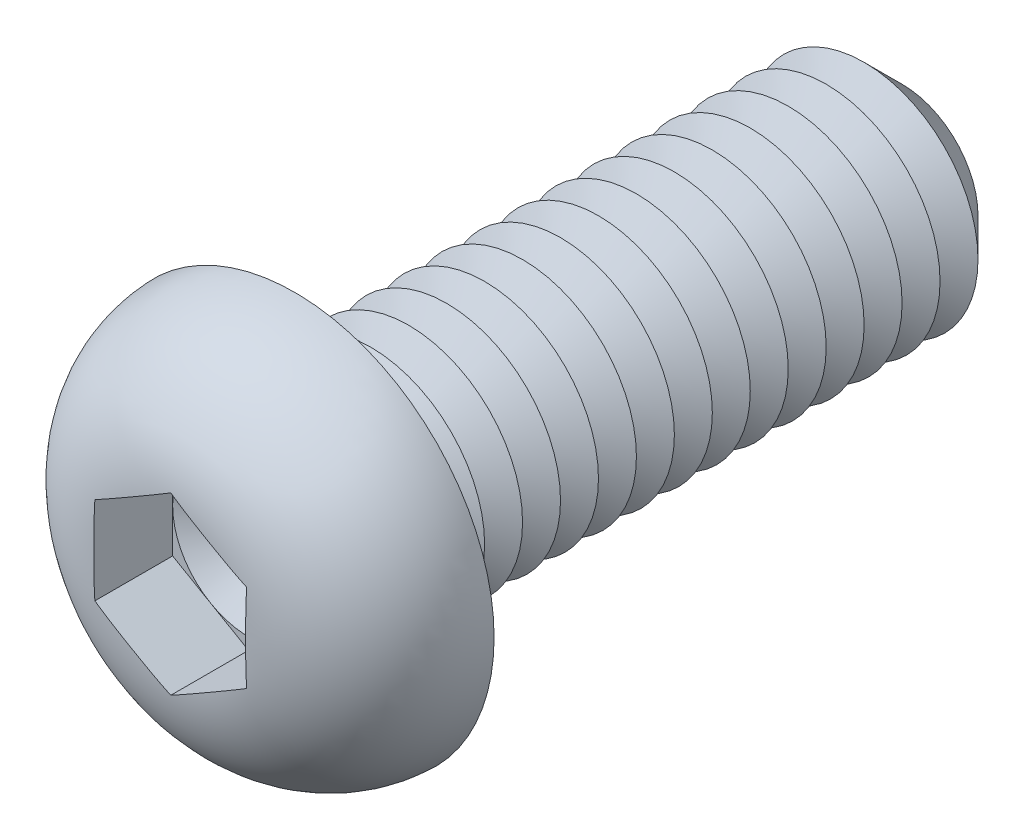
ISO-10303-21;
HEADER;
FILE_DESCRIPTION(('STEP AP214'),'2;1');
FILE_NAME('part.step','',(''),(''),'','','');
FILE_SCHEMA(('AUTOMOTIVE_DESIGN { 1 0 10303 214 1 1 1 1 }'));
ENDSEC;
DATA;
#1=APPLICATION_CONTEXT('core data for automotive mechanical design processes');
#2=APPLICATION_PROTOCOL_DEFINITION('international standard','automotive_design',2000,#1);
#3=PRODUCT_CONTEXT('',#1,'mechanical');
#4=PRODUCT('Part','Part','',(#3));
#5=PRODUCT_RELATED_PRODUCT_CATEGORY('part','',(#4));
#6=PRODUCT_DEFINITION_FORMATION('','',#4);
#7=PRODUCT_DEFINITION_CONTEXT('part definition',#1,'design');
#8=PRODUCT_DEFINITION('design','',#6,#7);
#9=PRODUCT_DEFINITION_SHAPE('','',#8);
#10=(LENGTH_UNIT() NAMED_UNIT(*) SI_UNIT(.MILLI.,.METRE.));
#11=(NAMED_UNIT(*) PLANE_ANGLE_UNIT() SI_UNIT($,.RADIAN.));
#12=(NAMED_UNIT(*) SI_UNIT($,.STERADIAN.) SOLID_ANGLE_UNIT());
#13=UNCERTAINTY_MEASURE_WITH_UNIT(LENGTH_MEASURE(1.E-05),#10,'distance_accuracy_value','');
#14=(GEOMETRIC_REPRESENTATION_CONTEXT(3) GLOBAL_UNCERTAINTY_ASSIGNED_CONTEXT((#13)) GLOBAL_UNIT_ASSIGNED_CONTEXT((#10,
#11,#12)) REPRESENTATION_CONTEXT('',''));
#15=CARTESIAN_POINT('',(0.,0.,0.));
#16=DIRECTION('',(0.,0.,1.));
#17=DIRECTION('',(1.,0.,0.));
#18=AXIS2_PLACEMENT_3D('',#15,#16,#17);
#19=CARTESIAN_POINT('',(0.,0.,1.22));
#20=DIRECTION('',(0.,0.,1.));
#21=DIRECTION('',(1.,0.,0.));
#22=AXIS2_PLACEMENT_3D('',#19,#20,#21);
#23=PLANE('',#22);
#24=CARTESIAN_POINT('',(0.,0.,1.22));
#25=DIRECTION('',(0.,0.,1.));
#26=DIRECTION('',(1.,0.,0.));
#27=AXIS2_PLACEMENT_3D('',#24,#25,#26);
#28=CIRCLE('',#27,2.);
#29=CARTESIAN_POINT('',(2.,0.,1.22));
#30=VERTEX_POINT('',#29);
#31=CARTESIAN_POINT('',(1.,1.73205080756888,1.22));
#32=VERTEX_POINT('',#31);
#33=EDGE_CURVE('E117',#30,#32,#28,.T.);
#34=ORIENTED_EDGE('',*,*,#33,.F.);
#35=DIRECTION('',(0.,1.,0.));
#36=VECTOR('',#35,1.);
#37=CARTESIAN_POINT('',(2.,-1.15470053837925,1.22));
#38=LINE('',#37,#36);
#39=CARTESIAN_POINT('',(2.,1.15470053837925,1.22));
#40=VERTEX_POINT('',#39);
#41=EDGE_CURVE('E140',#30,#40,#38,.T.);
#42=ORIENTED_EDGE('',*,*,#41,.T.);
#43=DIRECTION('',(-0.866025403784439,0.5,0.));
#44=VECTOR('',#43,1.);
#45=CARTESIAN_POINT('',(2.,1.15470053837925,1.22));
#46=LINE('',#45,#44);
#47=EDGE_CURVE('E136',#40,#32,#46,.T.);
#48=ORIENTED_EDGE('',*,*,#47,.T.);
#49=EDGE_LOOP('',(#34,#42,#48));
#50=FACE_BOUND('',#49,.T.);
#51=ADVANCED_FACE('F39',(#50),#23,.T.);
#52=CARTESIAN_POINT('',(0.,0.,1.22));
#53=DIRECTION('',(0.,0.,1.));
#54=DIRECTION('',(1.,0.,0.));
#55=AXIS2_PLACEMENT_3D('',#52,#53,#54);
#56=CIRCLE('',#55,2.);
#57=CARTESIAN_POINT('',(-1.,1.73205080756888,1.22));
#58=VERTEX_POINT('',#57);
#59=EDGE_CURVE('E11',#32,#58,#56,.T.);
#60=ORIENTED_EDGE('',*,*,#59,.F.);
#61=CARTESIAN_POINT('',(0.,2.3094010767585,1.22));
#62=VERTEX_POINT('',#61);
#63=EDGE_CURVE('E130',#32,#62,#46,.T.);
#64=ORIENTED_EDGE('',*,*,#63,.T.);
#65=DIRECTION('',(-0.866025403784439,-0.5,0.));
#66=VECTOR('',#65,1.);
#67=CARTESIAN_POINT('',(0.,2.3094010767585,1.22));
#68=LINE('',#67,#66);
#69=EDGE_CURVE('E131',#62,#58,#68,.T.);
#70=ORIENTED_EDGE('',*,*,#69,.T.);
#71=EDGE_LOOP('',(#60,#64,#70));
#72=FACE_BOUND('',#71,.T.);
#73=ADVANCED_FACE('F129',(#72),#23,.T.);
#74=CARTESIAN_POINT('',(-2.,0.,1.22));
#75=VERTEX_POINT('',#74);
#76=EDGE_CURVE('E49',#58,#75,#56,.T.);
#77=ORIENTED_EDGE('',*,*,#76,.F.);
#78=CARTESIAN_POINT('',(-2.,1.15470053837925,1.22));
#79=VERTEX_POINT('',#78);
#80=EDGE_CURVE('E143',#58,#79,#68,.T.);
#81=ORIENTED_EDGE('',*,*,#80,.T.);
#82=DIRECTION('',(0.,-1.,0.));
#83=VECTOR('',#82,1.);
#84=CARTESIAN_POINT('',(-2.,1.15470053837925,1.22));
#85=LINE('',#84,#83);
#86=EDGE_CURVE('E153',#79,#75,#85,.T.);
#87=ORIENTED_EDGE('',*,*,#86,.T.);
#88=EDGE_LOOP('',(#77,#81,#87));
#89=FACE_BOUND('',#88,.T.);
#90=ADVANCED_FACE('F269',(#89),#23,.T.);
#91=CARTESIAN_POINT('',(-1.,-1.73205080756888,1.22));
#92=VERTEX_POINT('',#91);
#93=EDGE_CURVE('E254',#75,#92,#56,.T.);
#94=ORIENTED_EDGE('',*,*,#93,.F.);
#95=CARTESIAN_POINT('',(-2.,-1.15470053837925,1.22));
#96=VERTEX_POINT('',#95);
#97=EDGE_CURVE('E152',#75,#96,#85,.T.);
#98=ORIENTED_EDGE('',*,*,#97,.T.);
#99=DIRECTION('',(0.866025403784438,-0.5,0.));
#100=VECTOR('',#99,1.);
#101=CARTESIAN_POINT('',(-2.,-1.15470053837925,1.22));
#102=LINE('',#101,#100);
#103=EDGE_CURVE('E158',#96,#92,#102,.T.);
#104=ORIENTED_EDGE('',*,*,#103,.T.);
#105=EDGE_LOOP('',(#94,#98,#104));
#106=FACE_BOUND('',#105,.T.);
#107=ADVANCED_FACE('F263',(#106),#23,.T.);
#108=CARTESIAN_POINT('',(0.999999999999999,-1.73205080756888,1.22));
#109=VERTEX_POINT('',#108);
#110=EDGE_CURVE('E56',#92,#109,#56,.T.);
#111=ORIENTED_EDGE('',*,*,#110,.F.);
#112=CARTESIAN_POINT('',(0.,-2.3094010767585,1.22));
#113=VERTEX_POINT('',#112);
#114=EDGE_CURVE('E157',#92,#113,#102,.T.);
#115=ORIENTED_EDGE('',*,*,#114,.T.);
#116=DIRECTION('',(0.866025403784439,0.5,0.));
#117=VECTOR('',#116,1.);
#118=CARTESIAN_POINT('',(0.,-2.3094010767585,1.22));
#119=LINE('',#118,#117);
#120=EDGE_CURVE('E163',#113,#109,#119,.T.);
#121=ORIENTED_EDGE('',*,*,#120,.T.);
#122=EDGE_LOOP('',(#111,#115,#121));
#123=FACE_BOUND('',#122,.T.);
#124=ADVANCED_FACE('F306',(#123),#23,.T.);
#125=CARTESIAN_POINT('',(0.,0.,-16.));
#126=DIRECTION('',(0.,0.,1.));
#127=DIRECTION('',(1.,0.,0.));
#128=AXIS2_PLACEMENT_3D('',#125,#126,#127);
#129=CYLINDRICAL_SURFACE('',#128,3.);
#130=CARTESIAN_POINT('',(0.,0.,-0.5));
#131=DIRECTION('',(0.,0.,1.));
#132=DIRECTION('',(1.,0.,0.));
#133=AXIS2_PLACEMENT_3D('',#130,#131,#132);
#134=CIRCLE('',#133,3.);
#135=CARTESIAN_POINT('',(3.,0.,-0.5));
#136=VERTEX_POINT('',#135);
#137=EDGE_CURVE('E242',#136,#136,#134,.F.);
#138=ORIENTED_EDGE('',*,*,#137,.T.);
#139=EDGE_LOOP('',(#138));
#140=FACE_BOUND('',#139,.T.);
#141=CARTESIAN_POINT('',(0.,0.,-1.));
#142=DIRECTION('',(0.,0.,1.));
#143=DIRECTION('',(1.,0.,0.));
#144=AXIS2_PLACEMENT_3D('',#141,#142,#143);
#145=CIRCLE('',#144,3.00000000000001);
#146=CARTESIAN_POINT('',(3.00000000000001,0.,-1.));
#147=VERTEX_POINT('',#146);
#148=EDGE_CURVE('E138',#147,#147,#145,.T.);
#149=ORIENTED_EDGE('',*,*,#148,.T.);
#150=EDGE_LOOP('',(#149));
#151=FACE_BOUND('',#150,.T.);
#152=ADVANCED_FACE('F307',(#140,#151),#129,.T.);
#153=CARTESIAN_POINT('',(0.,5.25,0.));
#154=DIRECTION('',(0.,0.,1.));
#155=DIRECTION('',(1.,0.,0.));
#156=AXIS2_PLACEMENT_3D('',#153,#154,#155);
#157=PLANE('',#156);
#158=CARTESIAN_POINT('',(0.,0.,0.));
#159=DIRECTION('',(0.,0.,1.));
#160=DIRECTION('',(1.,0.,0.));
#161=AXIS2_PLACEMENT_3D('',#158,#159,#160);
#162=CIRCLE('',#161,3.5);
#163=CARTESIAN_POINT('',(3.5,0.,0.));
#164=VERTEX_POINT('',#163);
#165=EDGE_CURVE('E244',#164,#164,#162,.T.);
#166=ORIENTED_EDGE('',*,*,#165,.T.);
#167=EDGE_LOOP('',(#166));
#168=FACE_BOUND('',#167,.T.);
#169=CARTESIAN_POINT('',(0.,0.,0.));
#170=DIRECTION('',(0.,0.,1.));
#171=DIRECTION('',(1.,0.,0.));
#172=AXIS2_PLACEMENT_3D('',#169,#170,#171);
#173=CIRCLE('',#172,5.25);
#174=CARTESIAN_POINT('',(5.25,0.,0.));
#175=VERTEX_POINT('',#174);
#176=EDGE_CURVE('E174',#175,#175,#173,.T.);
#177=ORIENTED_EDGE('',*,*,#176,.F.);
#178=EDGE_LOOP('',(#177));
#179=FACE_BOUND('',#178,.T.);
#180=ADVANCED_FACE('F310',(#168,#179),#157,.F.);
#181=CARTESIAN_POINT('',(0.,0.,-0.0999999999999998));
#182=DIRECTION('',(0.,0.,1.));
#183=DIRECTION('',(1.,0.,0.));
#184=AXIS2_PLACEMENT_3D('',#181,#182,#183);
#185=DEGENERATE_TOROIDAL_SURFACE('',#184,1.85147090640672,3.4,.T.);
#186=CARTESIAN_POINT('',(-2.0002,1.15458506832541,3.26900492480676));
#187=CARTESIAN_POINT('',(-1.91694658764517,1.20265144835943,3.27552708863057));
#188=CARTESIAN_POINT('',(-1.83362001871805,1.25076006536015,3.28041849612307));
#189=CARTESIAN_POINT('',(-1.66691146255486,1.34700929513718,3.28784569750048));
#190=CARTESIAN_POINT('',(-1.58352950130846,1.39514989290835,3.29038223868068));
#191=CARTESIAN_POINT('',(-1.4167967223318,1.49141310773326,3.29400753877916));
#192=CARTESIAN_POINT('',(-1.33344591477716,1.5395357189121,3.29509714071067));
#193=CARTESIAN_POINT('',(-1.16673007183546,1.63578915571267,3.29647051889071));
#194=CARTESIAN_POINT('',(-1.08336503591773,1.68391998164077,3.29675420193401));
#195=CARTESIAN_POINT('',(-0.916634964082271,1.78018163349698,3.29675420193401));
#196=CARTESIAN_POINT('',(-0.833269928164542,1.82831245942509,3.29647051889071));
#197=CARTESIAN_POINT('',(-0.666554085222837,1.92456589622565,3.29509714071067));
#198=CARTESIAN_POINT('',(-0.583203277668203,1.9726885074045,3.29400753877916));
#199=CARTESIAN_POINT('',(-0.416470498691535,2.06895172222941,3.29038223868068));
#200=CARTESIAN_POINT('',(-0.333088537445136,2.11709232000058,3.28784569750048));
#201=CARTESIAN_POINT('',(-0.166379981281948,2.21334154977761,3.28041849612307));
#202=CARTESIAN_POINT('',(-0.0830534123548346,2.26145016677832,3.27552708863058));
#203=CARTESIAN_POINT('',(0.000200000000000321,2.30951654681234,3.26900492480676));
#204=B_SPLINE_CURVE_WITH_KNOTS('',3,(#186,#187,#188,#189,#190,#191,#192,#193,#194,#195,#196,
#197,#198,#199,#200,#201,#202,#203),.UNSPECIFIED.,.F.,.F.,(4,2,2,2,2,2,2,2,4),(0.,
0.289010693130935,0.57792963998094,0.866680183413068,1.15546411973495,1.44424805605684,
1.73299859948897,2.02191754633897,2.31092823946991),.UNSPECIFIED.);
#205=CARTESIAN_POINT('',(-2.,1.15470053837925,3.26902062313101));
#206=VERTEX_POINT('',#205);
#207=CARTESIAN_POINT('',(1.70733705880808E-11,2.30940107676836,3.2690206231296));
#208=VERTEX_POINT('',#207);
#209=EDGE_CURVE('E196',#206,#208,#204,.T.);
#210=ORIENTED_EDGE('',*,*,#209,.T.);
#211=CARTESIAN_POINT('',(-0.000199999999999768,2.30951654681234,3.26900492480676));
#212=CARTESIAN_POINT('',(0.0830534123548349,2.26145016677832,3.27552708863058));
#213=CARTESIAN_POINT('',(0.166379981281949,2.21334154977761,3.28041849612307));
#214=CARTESIAN_POINT('',(0.333088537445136,2.11709232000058,3.28784569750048));
#215=CARTESIAN_POINT('',(0.416470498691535,2.06895172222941,3.29038223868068));
#216=CARTESIAN_POINT('',(0.583203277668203,1.9726885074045,3.29400753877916));
#217=CARTESIAN_POINT('',(0.666554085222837,1.92456589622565,3.29509714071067));
#218=CARTESIAN_POINT('',(0.833269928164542,1.82831245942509,3.29647051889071));
#219=CARTESIAN_POINT('',(0.916634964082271,1.78018163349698,3.29675420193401));
#220=CARTESIAN_POINT('',(1.08336503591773,1.68391998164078,3.29675420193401));
#221=CARTESIAN_POINT('',(1.16673007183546,1.63578915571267,3.29647051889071));
#222=CARTESIAN_POINT('',(1.33344591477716,1.5395357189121,3.29509714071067));
#223=CARTESIAN_POINT('',(1.4167967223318,1.49141310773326,3.29400753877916));
#224=CARTESIAN_POINT('',(1.58352950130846,1.39514989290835,3.29038223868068));
#225=CARTESIAN_POINT('',(1.66691146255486,1.34700929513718,3.28784569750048));
#226=CARTESIAN_POINT('',(1.83362001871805,1.25076006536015,3.28041849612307));
#227=CARTESIAN_POINT('',(1.91694658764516,1.20265144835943,3.27552708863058));
#228=CARTESIAN_POINT('',(2.0002,1.15458506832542,3.26900492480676));
#229=B_SPLINE_CURVE_WITH_KNOTS('',3,(#211,#212,#213,#214,#215,#216,#217,#218,#219,#220,#221,
#222,#223,#224,#225,#226,#227,#228),.UNSPECIFIED.,.F.,.F.,(4,2,2,2,2,2,2,2,4),(0.,
0.289010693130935,0.577929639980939,0.866680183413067,1.15546411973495,1.44424805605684,
1.73299859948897,2.02191754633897,2.31092823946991),.UNSPECIFIED.);
#230=CARTESIAN_POINT('',(2.,1.15470053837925,3.26902062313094));
#231=VERTEX_POINT('',#230);
#232=EDGE_CURVE('E225',#208,#231,#229,.T.);
#233=ORIENTED_EDGE('',*,*,#232,.T.);
#234=CARTESIAN_POINT('',(2.,0.,3.29675420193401));
#235=CARTESIAN_POINT('',(2.,-0.0838690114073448,3.29675159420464));
#236=CARTESIAN_POINT('',(2.,-0.167737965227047,3.29653427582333));
#237=CARTESIAN_POINT('',(2.,-0.335473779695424,3.29552217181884));
#238=CARTESIAN_POINT('',(2.,-0.419340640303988,3.29472737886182));
#239=CARTESIAN_POINT('',(2.,-0.587092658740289,3.29218243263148));
#240=CARTESIAN_POINT('',(2.,-0.670977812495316,3.29043194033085));
#241=CARTESIAN_POINT('',(2.,-0.838702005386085,3.28542814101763));
#242=CARTESIAN_POINT('',(2.,-0.922541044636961,3.28217483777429));
#243=CARTESIAN_POINT('',(2.,-1.173343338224,3.26923984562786));
#244=CARTESIAN_POINT('',(2.,-1.34017699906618,3.25638268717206));
#245=CARTESIAN_POINT('',(2.,-1.67225876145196,3.21731215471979));
#246=CARTESIAN_POINT('',(2.,-1.83750825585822,3.19111187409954));
#247=CARTESIAN_POINT('',(2.,-2.10571503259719,3.13417573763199));
#248=CARTESIAN_POINT('',(2.,-2.20973442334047,3.10844622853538));
#249=CARTESIAN_POINT('',(2.,-2.41562153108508,3.04936015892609));
#250=CARTESIAN_POINT('',(2.,-2.51748898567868,3.01600267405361));
#251=CARTESIAN_POINT('',(2.,-2.71832295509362,2.94120377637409));
#252=CARTESIAN_POINT('',(2.,-2.81728700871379,2.89975572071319));
#253=CARTESIAN_POINT('',(2.,-3.01134256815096,2.80859624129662));
#254=CARTESIAN_POINT('',(2.,-3.10643425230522,2.75888519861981));
#255=CARTESIAN_POINT('',(2.,-3.29253530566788,2.65079509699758));
#256=CARTESIAN_POINT('',(2.,-3.38350832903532,2.59235327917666));
#257=CARTESIAN_POINT('',(2.,-3.55964478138,2.46728791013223));
#258=CARTESIAN_POINT('',(2.,-3.64480873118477,2.40066509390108));
#259=CARTESIAN_POINT('',(2.,-3.80840353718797,2.25961603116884));
#260=CARTESIAN_POINT('',(2.,-3.88683504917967,2.18519054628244));
#261=CARTESIAN_POINT('',(2.,-4.03608847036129,2.02906828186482));
#262=CARTESIAN_POINT('',(2.,-4.106911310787,1.94737239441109));
#263=CARTESIAN_POINT('',(2.,-4.23287471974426,1.78665318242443));
#264=CARTESIAN_POINT('',(2.,-4.2888832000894,1.7083085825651));
#265=CARTESIAN_POINT('',(2.,-4.39372062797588,1.54691061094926));
#266=CARTESIAN_POINT('',(2.,-4.44254705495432,1.46385560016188));
#267=CARTESIAN_POINT('',(2.,-4.53249771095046,1.29375158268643));
#268=CARTESIAN_POINT('',(2.,-4.57362814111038,1.20670586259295));
#269=CARTESIAN_POINT('',(2.,-4.6478549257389,1.02924414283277));
#270=CARTESIAN_POINT('',(2.,-4.68094842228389,0.938826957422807));
#271=CARTESIAN_POINT('',(2.,-4.76413649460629,0.674747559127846));
#272=CARTESIAN_POINT('',(2.,-4.80368573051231,0.497625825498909));
#273=CARTESIAN_POINT('',(2.,-4.85179982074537,0.13932226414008));
#274=CARTESIAN_POINT('',(2.,-4.86036774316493,-0.0418591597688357));
#275=CARTESIAN_POINT('',(2.,-4.84642577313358,-0.399473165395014));
#276=CARTESIAN_POINT('',(2.,-4.82452156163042,-0.575929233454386));
#277=CARTESIAN_POINT('',(2.,-4.75142809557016,-0.922615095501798));
#278=CARTESIAN_POINT('',(2.,-4.70024536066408,-1.09284626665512));
#279=CARTESIAN_POINT('',(2.,-4.57020203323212,-1.42258491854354));
#280=CARTESIAN_POINT('',(2.,-4.49131097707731,-1.58208036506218));
#281=CARTESIAN_POINT('',(2.,-4.3083542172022,-1.8860021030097));
#282=CARTESIAN_POINT('',(2.,-4.2042742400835,-2.03041978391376));
#283=CARTESIAN_POINT('',(2.,-3.97174533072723,-2.30354399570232));
#284=CARTESIAN_POINT('',(2.,-3.84281347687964,-2.43183812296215));
#285=CARTESIAN_POINT('',(2.,-3.56631740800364,-2.66612298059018));
#286=CARTESIAN_POINT('',(2.,-3.41877418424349,-2.77213848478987));
#287=CARTESIAN_POINT('',(2.,-3.18261597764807,-2.91604941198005));
#288=CARTESIAN_POINT('',(2.,-3.09905663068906,-2.96247915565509));
#289=CARTESIAN_POINT('',(2.,-2.92856838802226,-3.04879370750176));
#290=CARTESIAN_POINT('',(2.,-2.84163827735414,-3.08867612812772));
#291=CARTESIAN_POINT('',(2.,-2.66495003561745,-3.16199567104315));
#292=CARTESIAN_POINT('',(2.,-2.57518752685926,-3.19542218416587));
#293=CARTESIAN_POINT('',(2.,-2.3936698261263,-3.25594506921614));
#294=CARTESIAN_POINT('',(2.,-2.30191676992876,-3.28304789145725));
#295=CARTESIAN_POINT('',(2.,-2.07265810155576,-3.34285611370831));
#296=CARTESIAN_POINT('',(2.,-1.93423373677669,-3.37205334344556));
#297=CARTESIAN_POINT('',(2.,-1.65546420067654,-3.419280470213));
#298=CARTESIAN_POINT('',(2.,-1.51511762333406,-3.43730169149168));
#299=CARTESIAN_POINT('',(2.,-1.23291689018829,-3.46473877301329));
#300=CARTESIAN_POINT('',(2.,-1.09105869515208,-3.47411015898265));
#301=CARTESIAN_POINT('',(2.,-0.807138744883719,-3.48717303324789));
#302=CARTESIAN_POINT('',(2.,-0.665077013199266,-3.4908651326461));
#303=CARTESIAN_POINT('',(2.,-0.451303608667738,-3.49429675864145));
#304=CARTESIAN_POINT('',(2.,-0.379602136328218,-3.49508825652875));
#305=CARTESIAN_POINT('',(2.,-0.236195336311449,-3.49619580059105));
#306=CARTESIAN_POINT('',(2.,-0.164490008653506,-3.49651184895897));
#307=CARTESIAN_POINT('',(2.,-0.0210718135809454,-3.49680708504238));
#308=CARTESIAN_POINT('',(2.,0.0506410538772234,-3.49678623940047));
#309=CARTESIAN_POINT('',(2.,0.194065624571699,-3.49639104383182));
#310=CARTESIAN_POINT('',(2.,0.265777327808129,-3.49601669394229));
#311=CARTESIAN_POINT('',(2.,0.480501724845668,-3.4941697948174));
#312=CARTESIAN_POINT('',(2.,0.623510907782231,-3.49197539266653));
#313=CARTESIAN_POINT('',(2.,0.909378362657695,-3.48318258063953));
#314=CARTESIAN_POINT('',(2.,1.05223667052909,-3.47658576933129));
#315=CARTESIAN_POINT('',(2.,1.30726724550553,-3.45800282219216));
#316=CARTESIAN_POINT('',(2.,1.41953767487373,-3.44745204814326));
#317=CARTESIAN_POINT('',(2.,1.64336701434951,-3.42020385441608));
#318=CARTESIAN_POINT('',(2.,1.75492585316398,-3.40350582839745));
#319=CARTESIAN_POINT('',(2.,1.97590795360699,-3.36293007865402));
#320=CARTESIAN_POINT('',(2.,2.08534088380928,-3.33910600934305));
#321=CARTESIAN_POINT('',(2.,2.30216001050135,-3.28336687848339));
#322=CARTESIAN_POINT('',(2.,2.40954602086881,-3.25145108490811));
#323=CARTESIAN_POINT('',(2.,2.62289868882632,-3.1784271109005));
#324=CARTESIAN_POINT('',(2.,2.72882262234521,-3.13719314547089));
#325=CARTESIAN_POINT('',(2.,2.93660837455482,-3.04548652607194));
#326=CARTESIAN_POINT('',(2.,3.03847031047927,-2.99501413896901));
#327=CARTESIAN_POINT('',(2.,3.23738754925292,-2.88459171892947));
#328=CARTESIAN_POINT('',(2.,3.33442546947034,-2.82461027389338));
#329=CARTESIAN_POINT('',(2.,3.52225616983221,-2.69545434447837));
#330=CARTESIAN_POINT('',(2.,3.61304636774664,-2.62627609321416));
#331=CARTESIAN_POINT('',(2.,3.77958578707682,-2.48563135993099));
#332=CARTESIAN_POINT('',(2.,3.85595570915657,-2.41489922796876));
#333=CARTESIAN_POINT('',(2.,4.00175744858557,-2.26661746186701));
#334=CARTESIAN_POINT('',(2.,4.07118992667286,-2.18906847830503));
#335=CARTESIAN_POINT('',(2.,4.20228235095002,-2.02784942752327));
#336=CARTESIAN_POINT('',(2.,4.26395450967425,-1.94418931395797));
#337=CARTESIAN_POINT('',(2.,4.37897455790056,-1.7713710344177));
#338=CARTESIAN_POINT('',(2.,4.43232318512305,-1.68221335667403));
#339=CARTESIAN_POINT('',(2.,4.5685109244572,-1.42722170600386));
#340=CARTESIAN_POINT('',(2.,4.64167742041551,-1.25607726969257));
#341=CARTESIAN_POINT('',(2.,4.75695354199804,-0.903699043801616));
#342=CARTESIAN_POINT('',(2.,4.79906366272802,-0.722465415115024));
#343=CARTESIAN_POINT('',(2.,4.84982785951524,-0.362243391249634));
#344=CARTESIAN_POINT('',(2.,4.85966759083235,-0.183422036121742));
#345=CARTESIAN_POINT('',(2.,4.84889099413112,0.17327689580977));
#346=CARTESIAN_POINT('',(2.,4.82827907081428,0.351154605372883));
#347=CARTESIAN_POINT('',(2.,4.75760776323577,0.699332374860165));
#348=CARTESIAN_POINT('',(2.,4.70780624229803,0.869684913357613));
#349=CARTESIAN_POINT('',(2.,4.58058971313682,1.199716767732));
#350=CARTESIAN_POINT('',(2.,4.50317623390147,1.35939667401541));
#351=CARTESIAN_POINT('',(2.,4.32230037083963,1.66542907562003));
#352=CARTESIAN_POINT('',(2.,4.21858077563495,1.81162931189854));
#353=CARTESIAN_POINT('',(2.,3.98879583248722,2.08527000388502));
#354=CARTESIAN_POINT('',(2.,3.86272429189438,2.21270524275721));
#355=CARTESIAN_POINT('',(2.,3.58743550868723,2.45020985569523));
#356=CARTESIAN_POINT('',(2.,3.43756474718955,2.55951924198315));
#357=CARTESIAN_POINT('',(2.,3.12282273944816,2.7535430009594));
#358=CARTESIAN_POINT('',(2.,2.95795742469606,2.83826704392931));
#359=CARTESIAN_POINT('',(2.,2.67096435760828,2.96064273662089));
#360=CARTESIAN_POINT('',(2.,2.55150855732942,3.00473766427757));
#361=CARTESIAN_POINT('',(2.,2.30905936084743,3.08191633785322));
#362=CARTESIAN_POINT('',(2.,2.18606487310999,3.11499664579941));
#363=CARTESIAN_POINT('',(2.,1.93761764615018,3.17114962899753));
#364=CARTESIAN_POINT('',(2.,1.8121607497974,3.19420352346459));
#365=CARTESIAN_POINT('',(2.,1.56000755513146,3.23170431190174));
#366=CARTESIAN_POINT('',(2.,1.43331126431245,3.24615125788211));
#367=CARTESIAN_POINT('',(2.,1.19785080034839,3.26676473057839));
#368=CARTESIAN_POINT('',(2.,1.08915974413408,3.27383022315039));
#369=CARTESIAN_POINT('',(2.,0.87159878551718,3.28448481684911));
#370=CARTESIAN_POINT('',(2.,0.762728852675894,3.28807324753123));
#371=CARTESIAN_POINT('',(2.,0.54488171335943,3.29312180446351));
#372=CARTESIAN_POINT('',(2.,0.435904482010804,3.29458062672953));
#373=CARTESIAN_POINT('',(2.,0.217951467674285,3.29639847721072));
#374=CARTESIAN_POINT('',(2.,0.108975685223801,3.29675759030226));
#375=CARTESIAN_POINT('',(2.,0.,3.29675420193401));
#376=B_SPLINE_CURVE_WITH_KNOTS('',3,(#234,#235,#236,#237,#238,#239,#240,#241,#242,#243,#244,
#245,#246,#247,#248,#249,#250,#251,#252,#253,#254,#255,#256,#257,#258,#259,#260,#261,#262,#263,
#264,#265,#266,#267,#268,#269,#270,#271,#272,#273,#274,#275,#276,#277,#278,#279,#280,#281,#282,
#283,#284,#285,#286,#287,#288,#289,#290,#291,#292,#293,#294,#295,#296,#297,#298,#299,#300,#301,
#302,#303,#304,#305,#306,#307,#308,#309,#310,#311,#312,#313,#314,#315,#316,#317,#318,#319,#320,
#321,#322,#323,#324,#325,#326,#327,#328,#329,#330,#331,#332,#333,#334,#335,#336,#337,#338,#339,
#340,#341,#342,#343,#344,#345,#346,#347,#348,#349,#350,#351,#352,#353,#354,#355,#356,#357,#358,
#359,#360,#361,#362,#363,#364,#365,#366,#367,#368,#369,#370,#371,#372,#373,#374,#375),
.UNSPECIFIED.,.T.,.F.,(4,2,2,2,2,2,2,2,2,2,2,2,2,2,2,2,2,2,2,2,2,2,2,2,2,2,2,2,2,2,2,2,2,2,2,2,
2,2,2,2,2,2,2,2,2,2,2,2,2,2,2,2,2,2,2,2,2,2,2,2,2,2,2,2,2,2,2,2,2,2,4),(0.,0.251606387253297,
0.503215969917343,0.754914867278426,1.00661313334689,1.50825543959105,2.00940643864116,
2.33061510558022,2.65186271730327,2.97337521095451,3.29487288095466,3.61880390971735,
3.94270585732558,4.26657621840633,4.59040689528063,4.8789527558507,5.16759964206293,
5.45601293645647,5.74452864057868,6.28608750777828,6.82759274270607,7.35848716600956,
7.8892634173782,8.42062506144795,8.95228851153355,9.49557283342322,10.0382497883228,
10.3247866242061,10.6114277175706,10.8985359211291,11.1853499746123,11.6091713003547,
12.0333212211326,12.4596400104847,12.8859129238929,13.1010304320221,13.316146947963,
13.5312847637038,13.746422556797,14.1754765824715,14.6043748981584,14.9425387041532,
15.2807358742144,15.6164481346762,15.9521907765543,16.2927694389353,16.6333382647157,
16.9750565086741,17.3169151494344,17.6287548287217,17.9405647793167,18.2518777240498,
18.5631630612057,19.1185081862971,19.6738444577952,20.20853386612,20.7431459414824,
21.2731049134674,21.8030345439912,22.3383600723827,22.8738341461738,23.4279697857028,
23.9818871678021,24.3633752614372,24.7449823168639,25.1273011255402,25.5096176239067,
25.8363061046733,26.163057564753,26.4900090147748,26.8169352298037),.UNSPECIFIED.);
#377=CARTESIAN_POINT('',(2.,-1.15470053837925,3.26902062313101));
#378=VERTEX_POINT('',#377);
#379=EDGE_CURVE('E234',#231,#378,#376,.T.);
#380=ORIENTED_EDGE('',*,*,#379,.T.);
#381=CARTESIAN_POINT('',(2.0002,-1.15458506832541,3.26900492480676));
#382=CARTESIAN_POINT('',(1.91694658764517,-1.20265144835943,3.27552708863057));
#383=CARTESIAN_POINT('',(1.83362001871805,-1.25076006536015,3.28041849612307));
#384=CARTESIAN_POINT('',(1.66691146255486,-1.34700929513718,3.28784569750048));
#385=CARTESIAN_POINT('',(1.58352950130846,-1.39514989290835,3.29038223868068));
#386=CARTESIAN_POINT('',(1.4167967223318,-1.49141310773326,3.29400753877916));
#387=CARTESIAN_POINT('',(1.33344591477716,-1.5395357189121,3.29509714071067));
#388=CARTESIAN_POINT('',(1.16673007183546,-1.63578915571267,3.29647051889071));
#389=CARTESIAN_POINT('',(1.08336503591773,-1.68391998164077,3.29675420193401));
#390=CARTESIAN_POINT('',(0.916634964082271,-1.78018163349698,3.29675420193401));
#391=CARTESIAN_POINT('',(0.833269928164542,-1.82831245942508,3.29647051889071));
#392=CARTESIAN_POINT('',(0.666554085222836,-1.92456589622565,3.29509714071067));
#393=CARTESIAN_POINT('',(0.583203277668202,-1.97268850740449,3.29400753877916));
#394=CARTESIAN_POINT('',(0.416470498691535,-2.06895172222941,3.29038223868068));
#395=CARTESIAN_POINT('',(0.333088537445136,-2.11709232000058,3.28784569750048));
#396=CARTESIAN_POINT('',(0.166379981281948,-2.2133415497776,3.28041849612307));
#397=CARTESIAN_POINT('',(0.0830534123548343,-2.26145016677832,3.27552708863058));
#398=CARTESIAN_POINT('',(-0.000200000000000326,-2.30951654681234,3.26900492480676));
#399=B_SPLINE_CURVE_WITH_KNOTS('',3,(#381,#382,#383,#384,#385,#386,#387,#388,#389,#390,#391,
#392,#393,#394,#395,#396,#397,#398),.UNSPECIFIED.,.F.,.F.,(4,2,2,2,2,2,2,2,4),(0.,
0.289010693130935,0.57792963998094,0.866680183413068,1.15546411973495,1.44424805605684,
1.73299859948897,2.02191754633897,2.31092823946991),.UNSPECIFIED.);
#400=CARTESIAN_POINT('',(0.,-2.3094010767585,3.26902062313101));
#401=VERTEX_POINT('',#400);
#402=EDGE_CURVE('E279',#378,#401,#399,.T.);
#403=ORIENTED_EDGE('',*,*,#402,.T.);
#404=CARTESIAN_POINT('',(0.000199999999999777,-2.30951654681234,3.26900492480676));
#405=CARTESIAN_POINT('',(-0.083053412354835,-2.26145016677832,3.27552708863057));
#406=CARTESIAN_POINT('',(-0.166379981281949,-2.21334154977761,3.28041849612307));
#407=CARTESIAN_POINT('',(-0.333088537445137,-2.11709232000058,3.28784569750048));
#408=CARTESIAN_POINT('',(-0.416470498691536,-2.06895172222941,3.29038223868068));
#409=CARTESIAN_POINT('',(-0.583203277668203,-1.97268850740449,3.29400753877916));
#410=CARTESIAN_POINT('',(-0.666554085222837,-1.92456589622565,3.29509714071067));
#411=CARTESIAN_POINT('',(-0.833269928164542,-1.82831245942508,3.29647051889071));
#412=CARTESIAN_POINT('',(-0.916634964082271,-1.78018163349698,3.29675420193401));
#413=CARTESIAN_POINT('',(-1.08336503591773,-1.68391998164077,3.29675420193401));
#414=CARTESIAN_POINT('',(-1.16673007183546,-1.63578915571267,3.29647051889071));
#415=CARTESIAN_POINT('',(-1.33344591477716,-1.5395357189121,3.29509714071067));
#416=CARTESIAN_POINT('',(-1.4167967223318,-1.49141310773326,3.29400753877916));
#417=CARTESIAN_POINT('',(-1.58352950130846,-1.39514989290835,3.29038223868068));
#418=CARTESIAN_POINT('',(-1.66691146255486,-1.34700929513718,3.28784569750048));
#419=CARTESIAN_POINT('',(-1.83362001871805,-1.25076006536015,3.28041849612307));
#420=CARTESIAN_POINT('',(-1.91694658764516,-1.20265144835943,3.27552708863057));
#421=CARTESIAN_POINT('',(-2.0002,-1.15458506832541,3.26900492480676));
#422=B_SPLINE_CURVE_WITH_KNOTS('',3,(#404,#405,#406,#407,#408,#409,#410,#411,#412,#413,#414,
#415,#416,#417,#418,#419,#420,#421),.UNSPECIFIED.,.F.,.F.,(4,2,2,2,2,2,2,2,4),(0.,
0.289010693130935,0.577929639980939,0.866680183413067,1.15546411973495,1.44424805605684,
1.73299859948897,2.02191754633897,2.31092823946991),.UNSPECIFIED.);
#423=CARTESIAN_POINT('',(-2.,-1.15470053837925,3.26902062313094));
#424=VERTEX_POINT('',#423);
#425=EDGE_CURVE('E276',#401,#424,#422,.T.);
#426=ORIENTED_EDGE('',*,*,#425,.T.);
#427=CARTESIAN_POINT('',(-2.,0.,3.29675420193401));
#428=CARTESIAN_POINT('',(-2.,0.0838690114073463,3.29675159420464));
#429=CARTESIAN_POINT('',(-2.,0.167737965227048,3.29653427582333));
#430=CARTESIAN_POINT('',(-2.,0.335473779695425,3.29552217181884));
#431=CARTESIAN_POINT('',(-2.,0.41934064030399,3.29472737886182));
#432=CARTESIAN_POINT('',(-2.,0.58709265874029,3.29218243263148));
#433=CARTESIAN_POINT('',(-2.,0.670977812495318,3.29043194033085));
#434=CARTESIAN_POINT('',(-2.,0.838702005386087,3.28542814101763));
#435=CARTESIAN_POINT('',(-2.,0.922541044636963,3.28217483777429));
#436=CARTESIAN_POINT('',(-2.,1.173343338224,3.26923984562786));
#437=CARTESIAN_POINT('',(-2.,1.34017699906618,3.25638268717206));
#438=CARTESIAN_POINT('',(-2.,1.67225876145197,3.21731215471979));
#439=CARTESIAN_POINT('',(-2.,1.83750825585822,3.19111187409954));
#440=CARTESIAN_POINT('',(-2.,2.10571503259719,3.13417573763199));
#441=CARTESIAN_POINT('',(-2.,2.20973442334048,3.10844622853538));
#442=CARTESIAN_POINT('',(-2.,2.41562153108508,3.04936015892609));
#443=CARTESIAN_POINT('',(-2.,2.51748898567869,3.01600267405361));
#444=CARTESIAN_POINT('',(-2.,2.71832295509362,2.94120377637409));
#445=CARTESIAN_POINT('',(-2.,2.81728700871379,2.89975572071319));
#446=CARTESIAN_POINT('',(-2.,3.01134256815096,2.80859624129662));
#447=CARTESIAN_POINT('',(-2.,3.10643425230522,2.75888519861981));
#448=CARTESIAN_POINT('',(-2.,3.29253530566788,2.65079509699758));
#449=CARTESIAN_POINT('',(-2.,3.38350832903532,2.59235327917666));
#450=CARTESIAN_POINT('',(-2.,3.55964478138,2.46728791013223));
#451=CARTESIAN_POINT('',(-2.,3.64480873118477,2.40066509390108));
#452=CARTESIAN_POINT('',(-2.,3.80840353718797,2.25961603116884));
#453=CARTESIAN_POINT('',(-2.,3.88683504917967,2.18519054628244));
#454=CARTESIAN_POINT('',(-2.,4.03608847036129,2.02906828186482));
#455=CARTESIAN_POINT('',(-2.,4.106911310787,1.94737239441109));
#456=CARTESIAN_POINT('',(-2.,4.23287471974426,1.78665318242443));
#457=CARTESIAN_POINT('',(-2.,4.2888832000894,1.7083085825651));
#458=CARTESIAN_POINT('',(-2.,4.39372062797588,1.54691061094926));
#459=CARTESIAN_POINT('',(-2.,4.44254705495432,1.46385560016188));
#460=CARTESIAN_POINT('',(-2.,4.53249771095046,1.29375158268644));
#461=CARTESIAN_POINT('',(-2.,4.57362814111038,1.20670586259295));
#462=CARTESIAN_POINT('',(-2.,4.6478549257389,1.02924414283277));
#463=CARTESIAN_POINT('',(-2.,4.68094842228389,0.938826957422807));
#464=CARTESIAN_POINT('',(-2.,4.76413649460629,0.674747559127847));
#465=CARTESIAN_POINT('',(-2.,4.80368573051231,0.497625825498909));
#466=CARTESIAN_POINT('',(-2.,4.85179982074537,0.13932226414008));
#467=CARTESIAN_POINT('',(-2.,4.86036774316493,-0.0418591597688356));
#468=CARTESIAN_POINT('',(-2.,4.84642577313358,-0.399473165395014));
#469=CARTESIAN_POINT('',(-2.,4.82452156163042,-0.575929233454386));
#470=CARTESIAN_POINT('',(-2.,4.75142809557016,-0.922615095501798));
#471=CARTESIAN_POINT('',(-2.,4.70024536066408,-1.09284626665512));
#472=CARTESIAN_POINT('',(-2.,4.57020203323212,-1.42258491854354));
#473=CARTESIAN_POINT('',(-2.,4.49131097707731,-1.58208036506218));
#474=CARTESIAN_POINT('',(-2.,4.3083542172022,-1.8860021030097));
#475=CARTESIAN_POINT('',(-2.,4.2042742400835,-2.03041978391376));
#476=CARTESIAN_POINT('',(-2.,3.97174533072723,-2.30354399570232));
#477=CARTESIAN_POINT('',(-2.,3.84281347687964,-2.43183812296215));
#478=CARTESIAN_POINT('',(-2.,3.56631740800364,-2.66612298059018));
#479=CARTESIAN_POINT('',(-2.,3.41877418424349,-2.77213848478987));
#480=CARTESIAN_POINT('',(-2.,3.18261597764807,-2.91604941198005));
#481=CARTESIAN_POINT('',(-2.,3.09905663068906,-2.96247915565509));
#482=CARTESIAN_POINT('',(-2.,2.92856838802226,-3.04879370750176));
#483=CARTESIAN_POINT('',(-2.,2.84163827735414,-3.08867612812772));
#484=CARTESIAN_POINT('',(-2.,2.66495003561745,-3.16199567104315));
#485=CARTESIAN_POINT('',(-2.,2.57518752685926,-3.19542218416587));
#486=CARTESIAN_POINT('',(-2.,2.3936698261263,-3.25594506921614));
#487=CARTESIAN_POINT('',(-2.,2.30191676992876,-3.28304789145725));
#488=CARTESIAN_POINT('',(-2.,2.07265810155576,-3.34285611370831));
#489=CARTESIAN_POINT('',(-2.,1.93423373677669,-3.37205334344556));
#490=CARTESIAN_POINT('',(-2.,1.65546420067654,-3.419280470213));
#491=CARTESIAN_POINT('',(-2.,1.51511762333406,-3.43730169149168));
#492=CARTESIAN_POINT('',(-2.,1.23291689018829,-3.46473877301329));
#493=CARTESIAN_POINT('',(-2.,1.09105869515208,-3.47411015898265));
#494=CARTESIAN_POINT('',(-2.,0.807138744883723,-3.48717303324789));
#495=CARTESIAN_POINT('',(-2.,0.66507701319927,-3.4908651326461));
#496=CARTESIAN_POINT('',(-2.,0.451303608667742,-3.49429675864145));
#497=CARTESIAN_POINT('',(-2.,0.379602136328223,-3.49508825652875));
#498=CARTESIAN_POINT('',(-2.,0.236195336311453,-3.49619580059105));
#499=CARTESIAN_POINT('',(-2.,0.16449000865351,-3.49651184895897));
#500=CARTESIAN_POINT('',(-2.,0.0210718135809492,-3.49680708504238));
#501=CARTESIAN_POINT('',(-2.,-0.0506410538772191,-3.49678623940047));
#502=CARTESIAN_POINT('',(-2.,-0.194065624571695,-3.49639104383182));
#503=CARTESIAN_POINT('',(-2.,-0.265777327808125,-3.49601669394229));
#504=CARTESIAN_POINT('',(-2.,-0.480501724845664,-3.4941697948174));
#505=CARTESIAN_POINT('',(-2.,-0.623510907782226,-3.49197539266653));
#506=CARTESIAN_POINT('',(-2.,-0.909378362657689,-3.48318258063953));
#507=CARTESIAN_POINT('',(-2.,-1.05223667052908,-3.47658576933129));
#508=CARTESIAN_POINT('',(-2.,-1.30726724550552,-3.45800282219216));
#509=CARTESIAN_POINT('',(-2.,-1.41953767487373,-3.44745204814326));
#510=CARTESIAN_POINT('',(-2.,-1.6433670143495,-3.42020385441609));
#511=CARTESIAN_POINT('',(-2.,-1.75492585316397,-3.40350582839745));
#512=CARTESIAN_POINT('',(-2.,-1.97590795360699,-3.36293007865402));
#513=CARTESIAN_POINT('',(-2.,-2.08534088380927,-3.33910600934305));
#514=CARTESIAN_POINT('',(-2.,-2.30216001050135,-3.28336687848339));
#515=CARTESIAN_POINT('',(-2.,-2.4095460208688,-3.25145108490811));
#516=CARTESIAN_POINT('',(-2.,-2.62289868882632,-3.1784271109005));
#517=CARTESIAN_POINT('',(-2.,-2.72882262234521,-3.13719314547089));
#518=CARTESIAN_POINT('',(-2.,-2.93660837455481,-3.04548652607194));
#519=CARTESIAN_POINT('',(-2.,-3.03847031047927,-2.99501413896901));
#520=CARTESIAN_POINT('',(-2.,-3.23738754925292,-2.88459171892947));
#521=CARTESIAN_POINT('',(-2.,-3.33442546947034,-2.82461027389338));
#522=CARTESIAN_POINT('',(-2.,-3.52225616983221,-2.69545434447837));
#523=CARTESIAN_POINT('',(-2.,-3.61304636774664,-2.62627609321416));
#524=CARTESIAN_POINT('',(-2.,-3.77958578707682,-2.48563135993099));
#525=CARTESIAN_POINT('',(-2.,-3.85595570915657,-2.41489922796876));
#526=CARTESIAN_POINT('',(-2.,-4.00175744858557,-2.26661746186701));
#527=CARTESIAN_POINT('',(-2.,-4.07118992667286,-2.18906847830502));
#528=CARTESIAN_POINT('',(-2.,-4.20228235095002,-2.02784942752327));
#529=CARTESIAN_POINT('',(-2.,-4.26395450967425,-1.94418931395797));
#530=CARTESIAN_POINT('',(-2.,-4.37897455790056,-1.7713710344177));
#531=CARTESIAN_POINT('',(-2.,-4.43232318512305,-1.68221335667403));
#532=CARTESIAN_POINT('',(-2.,-4.5685109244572,-1.42722170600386));
#533=CARTESIAN_POINT('',(-2.,-4.64167742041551,-1.25607726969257));
#534=CARTESIAN_POINT('',(-2.,-4.75695354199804,-0.903699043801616));
#535=CARTESIAN_POINT('',(-2.,-4.79906366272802,-0.722465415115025));
#536=CARTESIAN_POINT('',(-2.,-4.84982785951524,-0.362243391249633));
#537=CARTESIAN_POINT('',(-2.,-4.85966759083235,-0.18342203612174));
#538=CARTESIAN_POINT('',(-2.,-4.84889099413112,0.173276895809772));
#539=CARTESIAN_POINT('',(-2.,-4.82827907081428,0.351154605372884));
#540=CARTESIAN_POINT('',(-2.,-4.75760776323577,0.699332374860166));
#541=CARTESIAN_POINT('',(-2.,-4.70780624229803,0.869684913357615));
#542=CARTESIAN_POINT('',(-2.,-4.58058971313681,1.199716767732));
#543=CARTESIAN_POINT('',(-2.,-4.50317623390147,1.35939667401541));
#544=CARTESIAN_POINT('',(-2.,-4.32230037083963,1.66542907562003));
#545=CARTESIAN_POINT('',(-2.,-4.21858077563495,1.81162931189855));
#546=CARTESIAN_POINT('',(-2.,-3.98879583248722,2.08527000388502));
#547=CARTESIAN_POINT('',(-2.,-3.86272429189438,2.21270524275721));
#548=CARTESIAN_POINT('',(-2.,-3.58743550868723,2.45020985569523));
#549=CARTESIAN_POINT('',(-2.,-3.43756474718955,2.55951924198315));
#550=CARTESIAN_POINT('',(-2.,-3.12282273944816,2.7535430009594));
#551=CARTESIAN_POINT('',(-2.,-2.95795742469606,2.8382670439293));
#552=CARTESIAN_POINT('',(-2.,-2.67096435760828,2.96064273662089));
#553=CARTESIAN_POINT('',(-2.,-2.55150855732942,3.00473766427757));
#554=CARTESIAN_POINT('',(-2.,-2.30905936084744,3.08191633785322));
#555=CARTESIAN_POINT('',(-2.,-2.18606487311,3.11499664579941));
#556=CARTESIAN_POINT('',(-2.,-1.93761764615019,3.17114962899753));
#557=CARTESIAN_POINT('',(-2.,-1.81216074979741,3.19420352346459));
#558=CARTESIAN_POINT('',(-2.,-1.56000755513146,3.23170431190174));
#559=CARTESIAN_POINT('',(-2.,-1.43331126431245,3.24615125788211));
#560=CARTESIAN_POINT('',(-2.,-1.19785080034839,3.26676473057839));
#561=CARTESIAN_POINT('',(-2.,-1.08915974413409,3.27383022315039));
#562=CARTESIAN_POINT('',(-2.,-0.871598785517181,3.28448481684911));
#563=CARTESIAN_POINT('',(-2.,-0.762728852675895,3.28807324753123));
#564=CARTESIAN_POINT('',(-2.,-0.54488171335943,3.29312180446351));
#565=CARTESIAN_POINT('',(-2.,-0.435904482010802,3.29458062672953));
#566=CARTESIAN_POINT('',(-2.,-0.217951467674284,3.29639847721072));
#567=CARTESIAN_POINT('',(-2.,-0.108975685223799,3.29675759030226));
#568=CARTESIAN_POINT('',(-2.,0.,3.29675420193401));
#569=B_SPLINE_CURVE_WITH_KNOTS('',3,(#427,#428,#429,#430,#431,#432,#433,#434,#435,#436,#437,
#438,#439,#440,#441,#442,#443,#444,#445,#446,#447,#448,#449,#450,#451,#452,#453,#454,#455,#456,
#457,#458,#459,#460,#461,#462,#463,#464,#465,#466,#467,#468,#469,#470,#471,#472,#473,#474,#475,
#476,#477,#478,#479,#480,#481,#482,#483,#484,#485,#486,#487,#488,#489,#490,#491,#492,#493,#494,
#495,#496,#497,#498,#499,#500,#501,#502,#503,#504,#505,#506,#507,#508,#509,#510,#511,#512,#513,
#514,#515,#516,#517,#518,#519,#520,#521,#522,#523,#524,#525,#526,#527,#528,#529,#530,#531,#532,
#533,#534,#535,#536,#537,#538,#539,#540,#541,#542,#543,#544,#545,#546,#547,#548,#549,#550,#551,
#552,#553,#554,#555,#556,#557,#558,#559,#560,#561,#562,#563,#564,#565,#566,#567,#568),
.UNSPECIFIED.,.T.,.F.,(4,2,2,2,2,2,2,2,2,2,2,2,2,2,2,2,2,2,2,2,2,2,2,2,2,2,2,2,2,2,2,2,2,2,2,2,
2,2,2,2,2,2,2,2,2,2,2,2,2,2,2,2,2,2,2,2,2,2,2,2,2,2,2,2,2,2,2,2,2,2,4),(0.,0.251606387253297,
0.503215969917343,0.754914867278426,1.0066131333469,1.50825543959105,2.00940643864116,
2.33061510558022,2.65186271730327,2.97337521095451,3.29487288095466,3.61880390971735,
3.94270585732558,4.26657621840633,4.59040689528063,4.8789527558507,5.16759964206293,
5.45601293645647,5.74452864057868,6.28608750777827,6.82759274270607,7.35848716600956,
7.88926341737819,8.42062506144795,8.95228851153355,9.49557283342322,10.0382497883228,
10.3247866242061,10.6114277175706,10.8985359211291,11.1853499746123,11.6091713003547,
12.0333212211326,12.4596400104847,12.8859129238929,13.1010304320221,13.316146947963,
13.5312847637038,13.746422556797,14.1754765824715,14.6043748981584,14.9425387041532,
15.2807358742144,15.6164481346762,15.9521907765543,16.2927694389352,16.6333382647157,
16.9750565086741,17.3169151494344,17.6287548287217,17.9405647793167,18.2518777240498,
18.5631630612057,19.1185081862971,19.6738444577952,20.20853386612,20.7431459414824,
21.2731049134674,21.8030345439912,22.3383600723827,22.8738341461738,23.4279697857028,
23.981887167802,24.3633752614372,24.7449823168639,25.1273011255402,25.5096176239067,
25.8363061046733,26.163057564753,26.4900090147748,26.8169352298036),.UNSPECIFIED.);
#570=EDGE_CURVE('E205',#424,#206,#569,.T.);
#571=ORIENTED_EDGE('',*,*,#570,.T.);
#572=EDGE_LOOP('',(#210,#233,#380,#403,#426,#571));
#573=FACE_BOUND('',#572,.T.);
#574=ORIENTED_EDGE('',*,*,#176,.T.);
#575=EDGE_LOOP('',(#574));
#576=FACE_BOUND('',#575,.T.);
#577=ADVANCED_FACE('F210',(#573,#576),#185,.T.);
#578=CARTESIAN_POINT('',(2.,1.15470053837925,1.22));
#579=DIRECTION('',(0.5,0.866025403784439,0.));
#580=DIRECTION('',(-0.866025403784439,0.5,0.));
#581=AXIS2_PLACEMENT_3D('',#578,#579,#580);
#582=PLANE('',#581);
#583=DIRECTION('',(0.,0.,1.));
#584=VECTOR('',#583,1.);
#585=CARTESIAN_POINT('',(0.,2.3094010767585,1.22));
#586=LINE('',#585,#584);
#587=EDGE_CURVE('E64',#62,#208,#586,.T.);
#588=ORIENTED_EDGE('',*,*,#587,.F.);
#589=ORIENTED_EDGE('',*,*,#63,.F.);
#590=ORIENTED_EDGE('',*,*,#47,.F.);
#591=DIRECTION('',(0.,0.,1.));
#592=VECTOR('',#591,1.);
#593=CARTESIAN_POINT('',(2.,1.15470053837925,1.22));
#594=LINE('',#593,#592);
#595=EDGE_CURVE('E171',#40,#231,#594,.T.);
#596=ORIENTED_EDGE('',*,*,#595,.T.);
#597=ORIENTED_EDGE('',*,*,#232,.F.);
#598=EDGE_LOOP('',(#588,#589,#590,#596,#597));
#599=FACE_BOUND('',#598,.T.);
#600=ADVANCED_FACE('F134',(#599),#582,.F.);
#601=CARTESIAN_POINT('',(2.,-1.15470053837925,1.22));
#602=DIRECTION('',(1.,0.,0.));
#603=DIRECTION('',(0.,1.,0.));
#604=AXIS2_PLACEMENT_3D('',#601,#602,#603);
#605=PLANE('',#604);
#606=ORIENTED_EDGE('',*,*,#595,.F.);
#607=ORIENTED_EDGE('',*,*,#41,.F.);
#608=CARTESIAN_POINT('',(2.,-1.15470053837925,1.22));
#609=VERTEX_POINT('',#608);
#610=EDGE_CURVE('E167',#609,#30,#38,.T.);
#611=ORIENTED_EDGE('',*,*,#610,.F.);
#612=DIRECTION('',(0.,0.,1.));
#613=VECTOR('',#612,1.);
#614=CARTESIAN_POINT('',(2.,-1.15470053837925,1.22));
#615=LINE('',#614,#613);
#616=EDGE_CURVE('E175',#609,#378,#615,.T.);
#617=ORIENTED_EDGE('',*,*,#616,.T.);
#618=ORIENTED_EDGE('',*,*,#379,.F.);
#619=EDGE_LOOP('',(#606,#607,#611,#617,#618));
#620=FACE_BOUND('',#619,.T.);
#621=ADVANCED_FACE('F223',(#620),#605,.F.);
#622=CARTESIAN_POINT('',(0.,-2.3094010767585,1.22));
#623=DIRECTION('',(0.5,-0.866025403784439,0.));
#624=DIRECTION('',(0.866025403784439,0.5,0.));
#625=AXIS2_PLACEMENT_3D('',#622,#623,#624);
#626=PLANE('',#625);
#627=ORIENTED_EDGE('',*,*,#616,.F.);
#628=EDGE_CURVE('E162',#109,#609,#119,.T.);
#629=ORIENTED_EDGE('',*,*,#628,.F.);
#630=ORIENTED_EDGE('',*,*,#120,.F.);
#631=DIRECTION('',(0.,0.,1.));
#632=VECTOR('',#631,1.);
#633=CARTESIAN_POINT('',(0.,-2.3094010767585,1.22));
#634=LINE('',#633,#632);
#635=EDGE_CURVE('E179',#113,#401,#634,.T.);
#636=ORIENTED_EDGE('',*,*,#635,.T.);
#637=ORIENTED_EDGE('',*,*,#402,.F.);
#638=EDGE_LOOP('',(#627,#629,#630,#636,#637));
#639=FACE_BOUND('',#638,.T.);
#640=ADVANCED_FACE('F293',(#639),#626,.F.);
#641=CARTESIAN_POINT('',(-2.,-1.15470053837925,1.22));
#642=DIRECTION('',(-0.5,-0.866025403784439,0.));
#643=DIRECTION('',(0.866025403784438,-0.5,0.));
#644=AXIS2_PLACEMENT_3D('',#641,#642,#643);
#645=PLANE('',#644);
#646=ORIENTED_EDGE('',*,*,#635,.F.);
#647=ORIENTED_EDGE('',*,*,#114,.F.);
#648=ORIENTED_EDGE('',*,*,#103,.F.);
#649=DIRECTION('',(0.,0.,1.));
#650=VECTOR('',#649,1.);
#651=CARTESIAN_POINT('',(-2.,-1.15470053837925,1.22));
#652=LINE('',#651,#650);
#653=EDGE_CURVE('E183',#96,#424,#652,.T.);
#654=ORIENTED_EDGE('',*,*,#653,.T.);
#655=ORIENTED_EDGE('',*,*,#425,.F.);
#656=EDGE_LOOP('',(#646,#647,#648,#654,#655));
#657=FACE_BOUND('',#656,.T.);
#658=ADVANCED_FACE('F290',(#657),#645,.F.);
#659=CARTESIAN_POINT('',(-2.,1.15470053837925,1.22));
#660=DIRECTION('',(-1.,0.,0.));
#661=DIRECTION('',(0.,-1.,0.));
#662=AXIS2_PLACEMENT_3D('',#659,#660,#661);
#663=PLANE('',#662);
#664=ORIENTED_EDGE('',*,*,#653,.F.);
#665=ORIENTED_EDGE('',*,*,#97,.F.);
#666=ORIENTED_EDGE('',*,*,#86,.F.);
#667=DIRECTION('',(0.,0.,1.));
#668=VECTOR('',#667,1.);
#669=CARTESIAN_POINT('',(-2.,1.15470053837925,1.22));
#670=LINE('',#669,#668);
#671=EDGE_CURVE('E187',#79,#206,#670,.T.);
#672=ORIENTED_EDGE('',*,*,#671,.T.);
#673=ORIENTED_EDGE('',*,*,#570,.F.);
#674=EDGE_LOOP('',(#664,#665,#666,#672,#673));
#675=FACE_BOUND('',#674,.T.);
#676=ADVANCED_FACE('F218',(#675),#663,.F.);
#677=CARTESIAN_POINT('',(0.,2.3094010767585,1.22));
#678=DIRECTION('',(-0.5,0.866025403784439,0.));
#679=DIRECTION('',(-0.866025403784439,-0.5,0.));
#680=AXIS2_PLACEMENT_3D('',#677,#678,#679);
#681=PLANE('',#680);
#682=ORIENTED_EDGE('',*,*,#671,.F.);
#683=ORIENTED_EDGE('',*,*,#80,.F.);
#684=ORIENTED_EDGE('',*,*,#69,.F.);
#685=ORIENTED_EDGE('',*,*,#587,.T.);
#686=ORIENTED_EDGE('',*,*,#209,.F.);
#687=EDGE_LOOP('',(#682,#683,#684,#685,#686));
#688=FACE_BOUND('',#687,.T.);
#689=ADVANCED_FACE('F214',(#688),#681,.F.);
#690=EDGE_CURVE('E43',#109,#30,#56,.T.);
#691=ORIENTED_EDGE('',*,*,#690,.F.);
#692=ORIENTED_EDGE('',*,*,#628,.T.);
#693=ORIENTED_EDGE('',*,*,#610,.T.);
#694=EDGE_LOOP('',(#691,#692,#693));
#695=FACE_BOUND('',#694,.T.);
#696=ADVANCED_FACE('F217',(#695),#23,.T.);
#697=CARTESIAN_POINT('',(0.,0.,-1.));
#698=DIRECTION('',(0.,0.,1.));
#699=DIRECTION('',(1.,0.,0.));
#700=AXIS2_PLACEMENT_3D('',#697,#698,#699);
#701=CONICAL_SURFACE('',#700,3.00000000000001,1.0471975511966);
#702=CARTESIAN_POINT('',(0.,0.,-1.5));
#703=DIRECTION('',(0.,0.,1.));
#704=DIRECTION('',(1.,0.,0.));
#705=AXIS2_PLACEMENT_3D('',#702,#703,#704);
#706=CIRCLE('',#705,2.13397459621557);
#707=CARTESIAN_POINT('',(2.13397459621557,0.,-1.5));
#708=VERTEX_POINT('',#707);
#709=EDGE_CURVE('E452',#708,#708,#706,.T.);
#710=ORIENTED_EDGE('',*,*,#709,.T.);
#711=EDGE_LOOP('',(#710));
#712=FACE_BOUND('',#711,.T.);
#713=ORIENTED_EDGE('',*,*,#148,.F.);
#714=EDGE_LOOP('',(#713));
#715=FACE_BOUND('',#714,.T.);
#716=ADVANCED_FACE('F304',(#712,#715),#701,.T.);
#717=CARTESIAN_POINT('',(0.,0.,-1.5));
#718=DIRECTION('',(0.,0.,-1.));
#719=DIRECTION('',(-1.,0.,0.));
#720=AXIS2_PLACEMENT_3D('',#717,#718,#719);
#721=CONICAL_SURFACE('',#720,2.13397459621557,1.0471975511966);
#722=CARTESIAN_POINT('',(0.,0.,-2.));
#723=DIRECTION('',(0.,0.,1.));
#724=DIRECTION('',(1.,0.,0.));
#725=AXIS2_PLACEMENT_3D('',#722,#723,#724);
#726=CIRCLE('',#725,3.00000000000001);
#727=CARTESIAN_POINT('',(3.00000000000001,0.,-2.));
#728=VERTEX_POINT('',#727);
#729=EDGE_CURVE('E485',#728,#728,#726,.T.);
#730=ORIENTED_EDGE('',*,*,#729,.T.);
#731=EDGE_LOOP('',(#730));
#732=FACE_BOUND('',#731,.T.);
#733=ORIENTED_EDGE('',*,*,#709,.F.);
#734=EDGE_LOOP('',(#733));
#735=FACE_BOUND('',#734,.T.);
#736=ADVANCED_FACE('F320',(#732,#735),#721,.T.);
#737=CARTESIAN_POINT('',(0.,0.,-2.));
#738=DIRECTION('',(0.,0.,1.));
#739=DIRECTION('',(1.,0.,0.));
#740=AXIS2_PLACEMENT_3D('',#737,#738,#739);
#741=CONICAL_SURFACE('',#740,3.00000000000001,1.0471975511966);
#742=CARTESIAN_POINT('',(0.,0.,-2.5));
#743=DIRECTION('',(0.,0.,1.));
#744=DIRECTION('',(1.,0.,0.));
#745=AXIS2_PLACEMENT_3D('',#742,#743,#744);
#746=CIRCLE('',#745,2.13397459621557);
#747=CARTESIAN_POINT('',(2.13397459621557,0.,-2.5));
#748=VERTEX_POINT('',#747);
#749=EDGE_CURVE('E476',#748,#748,#746,.T.);
#750=ORIENTED_EDGE('',*,*,#749,.T.);
#751=EDGE_LOOP('',(#750));
#752=FACE_BOUND('',#751,.T.);
#753=ORIENTED_EDGE('',*,*,#729,.F.);
#754=EDGE_LOOP('',(#753));
#755=FACE_BOUND('',#754,.T.);
#756=ADVANCED_FACE('F324',(#752,#755),#741,.T.);
#757=CARTESIAN_POINT('',(0.,0.,-2.5));
#758=DIRECTION('',(0.,0.,-1.));
#759=DIRECTION('',(-1.,0.,0.));
#760=AXIS2_PLACEMENT_3D('',#757,#758,#759);
#761=CONICAL_SURFACE('',#760,2.13397459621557,1.0471975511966);
#762=CARTESIAN_POINT('',(0.,0.,-3.));
#763=DIRECTION('',(0.,0.,1.));
#764=DIRECTION('',(1.,0.,0.));
#765=AXIS2_PLACEMENT_3D('',#762,#763,#764);
#766=CIRCLE('',#765,3.00000000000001);
#767=CARTESIAN_POINT('',(3.00000000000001,0.,-3.));
#768=VERTEX_POINT('',#767);
#769=EDGE_CURVE('E472',#768,#768,#766,.T.);
#770=ORIENTED_EDGE('',*,*,#769,.T.);
#771=EDGE_LOOP('',(#770));
#772=FACE_BOUND('',#771,.T.);
#773=ORIENTED_EDGE('',*,*,#749,.F.);
#774=EDGE_LOOP('',(#773));
#775=FACE_BOUND('',#774,.T.);
#776=ADVANCED_FACE('F328',(#772,#775),#761,.T.);
#777=CARTESIAN_POINT('',(0.,0.,-3.));
#778=DIRECTION('',(0.,0.,1.));
#779=DIRECTION('',(1.,0.,0.));
#780=AXIS2_PLACEMENT_3D('',#777,#778,#779);
#781=CONICAL_SURFACE('',#780,3.00000000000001,1.0471975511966);
#782=CARTESIAN_POINT('',(0.,0.,-3.5));
#783=DIRECTION('',(0.,0.,1.));
#784=DIRECTION('',(1.,0.,0.));
#785=AXIS2_PLACEMENT_3D('',#782,#783,#784);
#786=CIRCLE('',#785,2.13397459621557);
#787=CARTESIAN_POINT('',(2.13397459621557,0.,-3.5));
#788=VERTEX_POINT('',#787);
#789=EDGE_CURVE('E470',#788,#788,#786,.T.);
#790=ORIENTED_EDGE('',*,*,#789,.T.);
#791=EDGE_LOOP('',(#790));
#792=FACE_BOUND('',#791,.T.);
#793=ORIENTED_EDGE('',*,*,#769,.F.);
#794=EDGE_LOOP('',(#793));
#795=FACE_BOUND('',#794,.T.);
#796=ADVANCED_FACE('F332',(#792,#795),#781,.T.);
#797=CARTESIAN_POINT('',(0.,0.,-3.5));
#798=DIRECTION('',(0.,0.,-1.));
#799=DIRECTION('',(-1.,0.,0.));
#800=AXIS2_PLACEMENT_3D('',#797,#798,#799);
#801=CONICAL_SURFACE('',#800,2.13397459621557,1.0471975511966);
#802=CARTESIAN_POINT('',(0.,0.,-4.));
#803=DIRECTION('',(0.,0.,1.));
#804=DIRECTION('',(1.,0.,0.));
#805=AXIS2_PLACEMENT_3D('',#802,#803,#804);
#806=CIRCLE('',#805,3.00000000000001);
#807=CARTESIAN_POINT('',(3.00000000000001,0.,-4.));
#808=VERTEX_POINT('',#807);
#809=EDGE_CURVE('E463',#808,#808,#806,.T.);
#810=ORIENTED_EDGE('',*,*,#809,.T.);
#811=EDGE_LOOP('',(#810));
#812=FACE_BOUND('',#811,.T.);
#813=ORIENTED_EDGE('',*,*,#789,.F.);
#814=EDGE_LOOP('',(#813));
#815=FACE_BOUND('',#814,.T.);
#816=ADVANCED_FACE('F336',(#812,#815),#801,.T.);
#817=CARTESIAN_POINT('',(0.,0.,-4.));
#818=DIRECTION('',(0.,0.,1.));
#819=DIRECTION('',(1.,0.,0.));
#820=AXIS2_PLACEMENT_3D('',#817,#818,#819);
#821=CONICAL_SURFACE('',#820,3.00000000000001,1.0471975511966);
#822=CARTESIAN_POINT('',(0.,0.,-4.5));
#823=DIRECTION('',(0.,0.,1.));
#824=DIRECTION('',(1.,0.,0.));
#825=AXIS2_PLACEMENT_3D('',#822,#823,#824);
#826=CIRCLE('',#825,2.13397459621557);
#827=CARTESIAN_POINT('',(2.13397459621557,0.,-4.5));
#828=VERTEX_POINT('',#827);
#829=EDGE_CURVE('E461',#828,#828,#826,.T.);
#830=ORIENTED_EDGE('',*,*,#829,.T.);
#831=EDGE_LOOP('',(#830));
#832=FACE_BOUND('',#831,.T.);
#833=ORIENTED_EDGE('',*,*,#809,.F.);
#834=EDGE_LOOP('',(#833));
#835=FACE_BOUND('',#834,.T.);
#836=ADVANCED_FACE('F340',(#832,#835),#821,.T.);
#837=CARTESIAN_POINT('',(0.,0.,-4.5));
#838=DIRECTION('',(0.,0.,-1.));
#839=DIRECTION('',(-1.,0.,0.));
#840=AXIS2_PLACEMENT_3D('',#837,#838,#839);
#841=CONICAL_SURFACE('',#840,2.13397459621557,1.0471975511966);
#842=CARTESIAN_POINT('',(0.,0.,-5.));
#843=DIRECTION('',(0.,0.,1.));
#844=DIRECTION('',(1.,0.,0.));
#845=AXIS2_PLACEMENT_3D('',#842,#843,#844);
#846=CIRCLE('',#845,3.00000000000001);
#847=CARTESIAN_POINT('',(3.00000000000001,0.,-5.));
#848=VERTEX_POINT('',#847);
#849=EDGE_CURVE('E464',#848,#848,#846,.T.);
#850=ORIENTED_EDGE('',*,*,#849,.T.);
#851=EDGE_LOOP('',(#850));
#852=FACE_BOUND('',#851,.T.);
#853=ORIENTED_EDGE('',*,*,#829,.F.);
#854=EDGE_LOOP('',(#853));
#855=FACE_BOUND('',#854,.T.);
#856=ADVANCED_FACE('F344',(#852,#855),#841,.T.);
#857=CARTESIAN_POINT('',(0.,0.,-5.));
#858=DIRECTION('',(0.,0.,1.));
#859=DIRECTION('',(1.,0.,0.));
#860=AXIS2_PLACEMENT_3D('',#857,#858,#859);
#861=CONICAL_SURFACE('',#860,3.00000000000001,1.0471975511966);
#862=CARTESIAN_POINT('',(0.,0.,-5.5));
#863=DIRECTION('',(0.,0.,1.));
#864=DIRECTION('',(1.,0.,0.));
#865=AXIS2_PLACEMENT_3D('',#862,#863,#864);
#866=CIRCLE('',#865,2.13397459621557);
#867=CARTESIAN_POINT('',(2.13397459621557,0.,-5.5));
#868=VERTEX_POINT('',#867);
#869=EDGE_CURVE('E496',#868,#868,#866,.T.);
#870=ORIENTED_EDGE('',*,*,#869,.T.);
#871=EDGE_LOOP('',(#870));
#872=FACE_BOUND('',#871,.T.);
#873=ORIENTED_EDGE('',*,*,#849,.F.);
#874=EDGE_LOOP('',(#873));
#875=FACE_BOUND('',#874,.T.);
#876=ADVANCED_FACE('F348',(#872,#875),#861,.T.);
#877=CARTESIAN_POINT('',(0.,0.,-5.5));
#878=DIRECTION('',(0.,0.,-1.));
#879=DIRECTION('',(-1.,0.,0.));
#880=AXIS2_PLACEMENT_3D('',#877,#878,#879);
#881=CONICAL_SURFACE('',#880,2.13397459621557,1.0471975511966);
#882=CARTESIAN_POINT('',(0.,0.,-6.));
#883=DIRECTION('',(0.,0.,1.));
#884=DIRECTION('',(1.,0.,0.));
#885=AXIS2_PLACEMENT_3D('',#882,#883,#884);
#886=CIRCLE('',#885,3.00000000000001);
#887=CARTESIAN_POINT('',(3.00000000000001,0.,-6.));
#888=VERTEX_POINT('',#887);
#889=EDGE_CURVE('E501',#888,#888,#886,.T.);
#890=ORIENTED_EDGE('',*,*,#889,.T.);
#891=EDGE_LOOP('',(#890));
#892=FACE_BOUND('',#891,.T.);
#893=ORIENTED_EDGE('',*,*,#869,.F.);
#894=EDGE_LOOP('',(#893));
#895=FACE_BOUND('',#894,.T.);
#896=ADVANCED_FACE('F352',(#892,#895),#881,.T.);
#897=CARTESIAN_POINT('',(0.,0.,-6.));
#898=DIRECTION('',(0.,0.,1.));
#899=DIRECTION('',(1.,0.,0.));
#900=AXIS2_PLACEMENT_3D('',#897,#898,#899);
#901=CONICAL_SURFACE('',#900,3.00000000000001,1.0471975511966);
#902=CARTESIAN_POINT('',(0.,0.,-6.5));
#903=DIRECTION('',(0.,0.,1.));
#904=DIRECTION('',(1.,0.,0.));
#905=AXIS2_PLACEMENT_3D('',#902,#903,#904);
#906=CIRCLE('',#905,2.13397459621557);
#907=CARTESIAN_POINT('',(2.13397459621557,0.,-6.5));
#908=VERTEX_POINT('',#907);
#909=EDGE_CURVE('E499',#908,#908,#906,.T.);
#910=ORIENTED_EDGE('',*,*,#909,.T.);
#911=EDGE_LOOP('',(#910));
#912=FACE_BOUND('',#911,.T.);
#913=ORIENTED_EDGE('',*,*,#889,.F.);
#914=EDGE_LOOP('',(#913));
#915=FACE_BOUND('',#914,.T.);
#916=ADVANCED_FACE('F356',(#912,#915),#901,.T.);
#917=CARTESIAN_POINT('',(0.,0.,-6.5));
#918=DIRECTION('',(0.,0.,-1.));
#919=DIRECTION('',(-1.,0.,0.));
#920=AXIS2_PLACEMENT_3D('',#917,#918,#919);
#921=CONICAL_SURFACE('',#920,2.13397459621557,1.0471975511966);
#922=CARTESIAN_POINT('',(0.,0.,-7.));
#923=DIRECTION('',(0.,0.,1.));
#924=DIRECTION('',(1.,0.,0.));
#925=AXIS2_PLACEMENT_3D('',#922,#923,#924);
#926=CIRCLE('',#925,3.00000000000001);
#927=CARTESIAN_POINT('',(3.00000000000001,0.,-7.));
#928=VERTEX_POINT('',#927);
#929=EDGE_CURVE('E458',#928,#928,#926,.T.);
#930=ORIENTED_EDGE('',*,*,#929,.T.);
#931=EDGE_LOOP('',(#930));
#932=FACE_BOUND('',#931,.T.);
#933=ORIENTED_EDGE('',*,*,#909,.F.);
#934=EDGE_LOOP('',(#933));
#935=FACE_BOUND('',#934,.T.);
#936=ADVANCED_FACE('F360',(#932,#935),#921,.T.);
#937=CARTESIAN_POINT('',(0.,0.,-7.));
#938=DIRECTION('',(0.,0.,1.));
#939=DIRECTION('',(1.,0.,0.));
#940=AXIS2_PLACEMENT_3D('',#937,#938,#939);
#941=CONICAL_SURFACE('',#940,3.00000000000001,1.0471975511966);
#942=CARTESIAN_POINT('',(0.,0.,-7.5));
#943=DIRECTION('',(0.,0.,1.));
#944=DIRECTION('',(1.,0.,0.));
#945=AXIS2_PLACEMENT_3D('',#942,#943,#944);
#946=CIRCLE('',#945,2.13397459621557);
#947=CARTESIAN_POINT('',(2.13397459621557,0.,-7.5));
#948=VERTEX_POINT('',#947);
#949=EDGE_CURVE('E455',#948,#948,#946,.T.);
#950=ORIENTED_EDGE('',*,*,#949,.T.);
#951=EDGE_LOOP('',(#950));
#952=FACE_BOUND('',#951,.T.);
#953=ORIENTED_EDGE('',*,*,#929,.F.);
#954=EDGE_LOOP('',(#953));
#955=FACE_BOUND('',#954,.T.);
#956=ADVANCED_FACE('F364',(#952,#955),#941,.T.);
#957=CARTESIAN_POINT('',(0.,0.,-7.5));
#958=DIRECTION('',(0.,0.,-1.));
#959=DIRECTION('',(-1.,0.,0.));
#960=AXIS2_PLACEMENT_3D('',#957,#958,#959);
#961=CONICAL_SURFACE('',#960,2.13397459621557,1.0471975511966);
#962=CARTESIAN_POINT('',(0.,0.,-8.));
#963=DIRECTION('',(0.,0.,1.));
#964=DIRECTION('',(1.,0.,0.));
#965=AXIS2_PLACEMENT_3D('',#962,#963,#964);
#966=CIRCLE('',#965,3.00000000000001);
#967=CARTESIAN_POINT('',(3.00000000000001,0.,-8.));
#968=VERTEX_POINT('',#967);
#969=EDGE_CURVE('E459',#968,#968,#966,.T.);
#970=ORIENTED_EDGE('',*,*,#969,.T.);
#971=EDGE_LOOP('',(#970));
#972=FACE_BOUND('',#971,.T.);
#973=ORIENTED_EDGE('',*,*,#949,.F.);
#974=EDGE_LOOP('',(#973));
#975=FACE_BOUND('',#974,.T.);
#976=ADVANCED_FACE('F368',(#972,#975),#961,.T.);
#977=CARTESIAN_POINT('',(0.,0.,-8.));
#978=DIRECTION('',(0.,0.,1.));
#979=DIRECTION('',(1.,0.,0.));
#980=AXIS2_PLACEMENT_3D('',#977,#978,#979);
#981=CONICAL_SURFACE('',#980,3.00000000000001,1.0471975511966);
#982=CARTESIAN_POINT('',(0.,0.,-8.5));
#983=DIRECTION('',(0.,0.,1.));
#984=DIRECTION('',(1.,0.,0.));
#985=AXIS2_PLACEMENT_3D('',#982,#983,#984);
#986=CIRCLE('',#985,2.13397459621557);
#987=CARTESIAN_POINT('',(2.13397459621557,0.,-8.5));
#988=VERTEX_POINT('',#987);
#989=EDGE_CURVE('E525',#988,#988,#986,.T.);
#990=ORIENTED_EDGE('',*,*,#989,.T.);
#991=EDGE_LOOP('',(#990));
#992=FACE_BOUND('',#991,.T.);
#993=ORIENTED_EDGE('',*,*,#969,.F.);
#994=EDGE_LOOP('',(#993));
#995=FACE_BOUND('',#994,.T.);
#996=ADVANCED_FACE('F372',(#992,#995),#981,.T.);
#997=CARTESIAN_POINT('',(0.,0.,-8.5));
#998=DIRECTION('',(0.,0.,-1.));
#999=DIRECTION('',(-1.,0.,0.));
#1000=AXIS2_PLACEMENT_3D('',#997,#998,#999);
#1001=CONICAL_SURFACE('',#1000,2.13397459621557,1.0471975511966);
#1002=CARTESIAN_POINT('',(0.,0.,-9.));
#1003=DIRECTION('',(0.,0.,1.));
#1004=DIRECTION('',(1.,0.,0.));
#1005=AXIS2_PLACEMENT_3D('',#1002,#1003,#1004);
#1006=CIRCLE('',#1005,3.00000000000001);
#1007=CARTESIAN_POINT('',(3.00000000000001,0.,-9.));
#1008=VERTEX_POINT('',#1007);
#1009=EDGE_CURVE('E529',#1008,#1008,#1006,.T.);
#1010=ORIENTED_EDGE('',*,*,#1009,.T.);
#1011=EDGE_LOOP('',(#1010));
#1012=FACE_BOUND('',#1011,.T.);
#1013=ORIENTED_EDGE('',*,*,#989,.F.);
#1014=EDGE_LOOP('',(#1013));
#1015=FACE_BOUND('',#1014,.T.);
#1016=ADVANCED_FACE('F376',(#1012,#1015),#1001,.T.);
#1017=CARTESIAN_POINT('',(0.,0.,-9.));
#1018=DIRECTION('',(0.,0.,1.));
#1019=DIRECTION('',(1.,0.,0.));
#1020=AXIS2_PLACEMENT_3D('',#1017,#1018,#1019);
#1021=CONICAL_SURFACE('',#1020,3.00000000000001,1.0471975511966);
#1022=CARTESIAN_POINT('',(0.,0.,-9.5));
#1023=DIRECTION('',(0.,0.,1.));
#1024=DIRECTION('',(1.,0.,0.));
#1025=AXIS2_PLACEMENT_3D('',#1022,#1023,#1024);
#1026=CIRCLE('',#1025,2.13397459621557);
#1027=CARTESIAN_POINT('',(2.13397459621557,0.,-9.5));
#1028=VERTEX_POINT('',#1027);
#1029=EDGE_CURVE('E533',#1028,#1028,#1026,.T.);
#1030=ORIENTED_EDGE('',*,*,#1029,.T.);
#1031=EDGE_LOOP('',(#1030));
#1032=FACE_BOUND('',#1031,.T.);
#1033=ORIENTED_EDGE('',*,*,#1009,.F.);
#1034=EDGE_LOOP('',(#1033));
#1035=FACE_BOUND('',#1034,.T.);
#1036=ADVANCED_FACE('F380',(#1032,#1035),#1021,.T.);
#1037=CARTESIAN_POINT('',(0.,0.,-9.5));
#1038=DIRECTION('',(0.,0.,-1.));
#1039=DIRECTION('',(-1.,0.,0.));
#1040=AXIS2_PLACEMENT_3D('',#1037,#1038,#1039);
#1041=CONICAL_SURFACE('',#1040,2.13397459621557,1.0471975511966);
#1042=CARTESIAN_POINT('',(0.,0.,-10.));
#1043=DIRECTION('',(0.,0.,1.));
#1044=DIRECTION('',(1.,0.,0.));
#1045=AXIS2_PLACEMENT_3D('',#1042,#1043,#1044);
#1046=CIRCLE('',#1045,3.00000000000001);
#1047=CARTESIAN_POINT('',(3.00000000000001,0.,-10.));
#1048=VERTEX_POINT('',#1047);
#1049=EDGE_CURVE('E536',#1048,#1048,#1046,.T.);
#1050=ORIENTED_EDGE('',*,*,#1049,.T.);
#1051=EDGE_LOOP('',(#1050));
#1052=FACE_BOUND('',#1051,.T.);
#1053=ORIENTED_EDGE('',*,*,#1029,.F.);
#1054=EDGE_LOOP('',(#1053));
#1055=FACE_BOUND('',#1054,.T.);
#1056=ADVANCED_FACE('F384',(#1052,#1055),#1041,.T.);
#1057=CARTESIAN_POINT('',(0.,0.,-10.));
#1058=DIRECTION('',(0.,0.,1.));
#1059=DIRECTION('',(1.,0.,0.));
#1060=AXIS2_PLACEMENT_3D('',#1057,#1058,#1059);
#1061=CONICAL_SURFACE('',#1060,3.00000000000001,1.0471975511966);
#1062=CARTESIAN_POINT('',(0.,0.,-10.5));
#1063=DIRECTION('',(0.,0.,1.));
#1064=DIRECTION('',(1.,0.,0.));
#1065=AXIS2_PLACEMENT_3D('',#1062,#1063,#1064);
#1066=CIRCLE('',#1065,2.13397459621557);
#1067=CARTESIAN_POINT('',(2.13397459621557,0.,-10.5));
#1068=VERTEX_POINT('',#1067);
#1069=EDGE_CURVE('E540',#1068,#1068,#1066,.T.);
#1070=ORIENTED_EDGE('',*,*,#1069,.T.);
#1071=EDGE_LOOP('',(#1070));
#1072=FACE_BOUND('',#1071,.T.);
#1073=ORIENTED_EDGE('',*,*,#1049,.F.);
#1074=EDGE_LOOP('',(#1073));
#1075=FACE_BOUND('',#1074,.T.);
#1076=ADVANCED_FACE('F388',(#1072,#1075),#1061,.T.);
#1077=CARTESIAN_POINT('',(0.,0.,-10.5));
#1078=DIRECTION('',(0.,0.,-1.));
#1079=DIRECTION('',(-1.,0.,0.));
#1080=AXIS2_PLACEMENT_3D('',#1077,#1078,#1079);
#1081=CONICAL_SURFACE('',#1080,2.13397459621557,1.0471975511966);
#1082=CARTESIAN_POINT('',(0.,0.,-11.));
#1083=DIRECTION('',(0.,0.,1.));
#1084=DIRECTION('',(1.,0.,0.));
#1085=AXIS2_PLACEMENT_3D('',#1082,#1083,#1084);
#1086=CIRCLE('',#1085,3.00000000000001);
#1087=CARTESIAN_POINT('',(3.00000000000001,0.,-11.));
#1088=VERTEX_POINT('',#1087);
#1089=EDGE_CURVE('E544',#1088,#1088,#1086,.T.);
#1090=ORIENTED_EDGE('',*,*,#1089,.T.);
#1091=EDGE_LOOP('',(#1090));
#1092=FACE_BOUND('',#1091,.T.);
#1093=ORIENTED_EDGE('',*,*,#1069,.F.);
#1094=EDGE_LOOP('',(#1093));
#1095=FACE_BOUND('',#1094,.T.);
#1096=ADVANCED_FACE('F392',(#1092,#1095),#1081,.T.);
#1097=CARTESIAN_POINT('',(0.,0.,-11.));
#1098=DIRECTION('',(0.,0.,1.));
#1099=DIRECTION('',(1.,0.,0.));
#1100=AXIS2_PLACEMENT_3D('',#1097,#1098,#1099);
#1101=CONICAL_SURFACE('',#1100,3.00000000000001,1.0471975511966);
#1102=CARTESIAN_POINT('',(0.,0.,-11.5));
#1103=DIRECTION('',(0.,0.,1.));
#1104=DIRECTION('',(1.,0.,0.));
#1105=AXIS2_PLACEMENT_3D('',#1102,#1103,#1104);
#1106=CIRCLE('',#1105,2.13397459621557);
#1107=CARTESIAN_POINT('',(2.13397459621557,0.,-11.5));
#1108=VERTEX_POINT('',#1107);
#1109=EDGE_CURVE('E548',#1108,#1108,#1106,.T.);
#1110=ORIENTED_EDGE('',*,*,#1109,.T.);
#1111=EDGE_LOOP('',(#1110));
#1112=FACE_BOUND('',#1111,.T.);
#1113=ORIENTED_EDGE('',*,*,#1089,.F.);
#1114=EDGE_LOOP('',(#1113));
#1115=FACE_BOUND('',#1114,.T.);
#1116=ADVANCED_FACE('F396',(#1112,#1115),#1101,.T.);
#1117=CARTESIAN_POINT('',(0.,0.,-11.5));
#1118=DIRECTION('',(0.,0.,-1.));
#1119=DIRECTION('',(-1.,0.,0.));
#1120=AXIS2_PLACEMENT_3D('',#1117,#1118,#1119);
#1121=CONICAL_SURFACE('',#1120,2.13397459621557,1.0471975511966);
#1122=CARTESIAN_POINT('',(0.,0.,-12.));
#1123=DIRECTION('',(0.,0.,1.));
#1124=DIRECTION('',(1.,0.,0.));
#1125=AXIS2_PLACEMENT_3D('',#1122,#1123,#1124);
#1126=CIRCLE('',#1125,3.00000000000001);
#1127=CARTESIAN_POINT('',(3.00000000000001,0.,-12.));
#1128=VERTEX_POINT('',#1127);
#1129=EDGE_CURVE('E552',#1128,#1128,#1126,.T.);
#1130=ORIENTED_EDGE('',*,*,#1129,.T.);
#1131=EDGE_LOOP('',(#1130));
#1132=FACE_BOUND('',#1131,.T.);
#1133=ORIENTED_EDGE('',*,*,#1109,.F.);
#1134=EDGE_LOOP('',(#1133));
#1135=FACE_BOUND('',#1134,.T.);
#1136=ADVANCED_FACE('F400',(#1132,#1135),#1121,.T.);
#1137=CARTESIAN_POINT('',(0.,0.,-12.));
#1138=DIRECTION('',(0.,0.,1.));
#1139=DIRECTION('',(1.,0.,0.));
#1140=AXIS2_PLACEMENT_3D('',#1137,#1138,#1139);
#1141=CONICAL_SURFACE('',#1140,3.00000000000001,1.0471975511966);
#1142=CARTESIAN_POINT('',(0.,0.,-12.5));
#1143=DIRECTION('',(0.,0.,1.));
#1144=DIRECTION('',(1.,0.,0.));
#1145=AXIS2_PLACEMENT_3D('',#1142,#1143,#1144);
#1146=CIRCLE('',#1145,2.13397459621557);
#1147=CARTESIAN_POINT('',(2.13397459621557,0.,-12.5));
#1148=VERTEX_POINT('',#1147);
#1149=EDGE_CURVE('E555',#1148,#1148,#1146,.T.);
#1150=ORIENTED_EDGE('',*,*,#1149,.T.);
#1151=EDGE_LOOP('',(#1150));
#1152=FACE_BOUND('',#1151,.T.);
#1153=ORIENTED_EDGE('',*,*,#1129,.F.);
#1154=EDGE_LOOP('',(#1153));
#1155=FACE_BOUND('',#1154,.T.);
#1156=ADVANCED_FACE('F404',(#1152,#1155),#1141,.T.);
#1157=CARTESIAN_POINT('',(0.,0.,-12.5));
#1158=DIRECTION('',(0.,0.,-1.));
#1159=DIRECTION('',(-1.,0.,0.));
#1160=AXIS2_PLACEMENT_3D('',#1157,#1158,#1159);
#1161=CONICAL_SURFACE('',#1160,2.13397459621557,1.0471975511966);
#1162=CARTESIAN_POINT('',(0.,0.,-13.));
#1163=DIRECTION('',(0.,0.,1.));
#1164=DIRECTION('',(1.,0.,0.));
#1165=AXIS2_PLACEMENT_3D('',#1162,#1163,#1164);
#1166=CIRCLE('',#1165,3.00000000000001);
#1167=CARTESIAN_POINT('',(3.00000000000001,0.,-13.));
#1168=VERTEX_POINT('',#1167);
#1169=EDGE_CURVE('E558',#1168,#1168,#1166,.T.);
#1170=ORIENTED_EDGE('',*,*,#1169,.T.);
#1171=EDGE_LOOP('',(#1170));
#1172=FACE_BOUND('',#1171,.T.);
#1173=ORIENTED_EDGE('',*,*,#1149,.F.);
#1174=EDGE_LOOP('',(#1173));
#1175=FACE_BOUND('',#1174,.T.);
#1176=ADVANCED_FACE('F408',(#1172,#1175),#1161,.T.);
#1177=CARTESIAN_POINT('',(0.,0.,-13.));
#1178=DIRECTION('',(0.,0.,1.));
#1179=DIRECTION('',(1.,0.,0.));
#1180=AXIS2_PLACEMENT_3D('',#1177,#1178,#1179);
#1181=CONICAL_SURFACE('',#1180,3.00000000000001,1.0471975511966);
#1182=CARTESIAN_POINT('',(0.,0.,-13.5));
#1183=DIRECTION('',(0.,0.,1.));
#1184=DIRECTION('',(1.,0.,0.));
#1185=AXIS2_PLACEMENT_3D('',#1182,#1183,#1184);
#1186=CIRCLE('',#1185,2.13397459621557);
#1187=CARTESIAN_POINT('',(2.13397459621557,0.,-13.5));
#1188=VERTEX_POINT('',#1187);
#1189=EDGE_CURVE('E562',#1188,#1188,#1186,.T.);
#1190=ORIENTED_EDGE('',*,*,#1189,.T.);
#1191=EDGE_LOOP('',(#1190));
#1192=FACE_BOUND('',#1191,.T.);
#1193=ORIENTED_EDGE('',*,*,#1169,.F.);
#1194=EDGE_LOOP('',(#1193));
#1195=FACE_BOUND('',#1194,.T.);
#1196=ADVANCED_FACE('F412',(#1192,#1195),#1181,.T.);
#1197=CARTESIAN_POINT('',(0.,0.,-13.5));
#1198=DIRECTION('',(0.,0.,-1.));
#1199=DIRECTION('',(-1.,0.,0.));
#1200=AXIS2_PLACEMENT_3D('',#1197,#1198,#1199);
#1201=CONICAL_SURFACE('',#1200,2.13397459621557,1.0471975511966);
#1202=CARTESIAN_POINT('',(0.,0.,-14.));
#1203=DIRECTION('',(0.,0.,1.));
#1204=DIRECTION('',(1.,0.,0.));
#1205=AXIS2_PLACEMENT_3D('',#1202,#1203,#1204);
#1206=CIRCLE('',#1205,3.00000000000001);
#1207=CARTESIAN_POINT('',(3.00000000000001,0.,-14.));
#1208=VERTEX_POINT('',#1207);
#1209=EDGE_CURVE('E566',#1208,#1208,#1206,.T.);
#1210=ORIENTED_EDGE('',*,*,#1209,.T.);
#1211=EDGE_LOOP('',(#1210));
#1212=FACE_BOUND('',#1211,.T.);
#1213=ORIENTED_EDGE('',*,*,#1189,.F.);
#1214=EDGE_LOOP('',(#1213));
#1215=FACE_BOUND('',#1214,.T.);
#1216=ADVANCED_FACE('F416',(#1212,#1215),#1201,.T.);
#1217=CARTESIAN_POINT('',(0.,0.,-14.));
#1218=DIRECTION('',(0.,0.,1.));
#1219=DIRECTION('',(1.,0.,0.));
#1220=AXIS2_PLACEMENT_3D('',#1217,#1218,#1219);
#1221=CONICAL_SURFACE('',#1220,3.00000000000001,1.0471975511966);
#1222=CARTESIAN_POINT('',(0.,0.,-14.5));
#1223=DIRECTION('',(0.,0.,1.));
#1224=DIRECTION('',(1.,0.,0.));
#1225=AXIS2_PLACEMENT_3D('',#1222,#1223,#1224);
#1226=CIRCLE('',#1225,2.13397459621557);
#1227=CARTESIAN_POINT('',(2.13397459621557,0.,-14.5));
#1228=VERTEX_POINT('',#1227);
#1229=EDGE_CURVE('E124',#1228,#1228,#1226,.T.);
#1230=ORIENTED_EDGE('',*,*,#1229,.T.);
#1231=EDGE_LOOP('',(#1230));
#1232=FACE_BOUND('',#1231,.T.);
#1233=ORIENTED_EDGE('',*,*,#1209,.F.);
#1234=EDGE_LOOP('',(#1233));
#1235=FACE_BOUND('',#1234,.T.);
#1236=ADVANCED_FACE('F420',(#1232,#1235),#1221,.T.);
#1237=CARTESIAN_POINT('',(0.,0.,-14.5));
#1238=DIRECTION('',(0.,0.,-1.));
#1239=DIRECTION('',(-1.,0.,0.));
#1240=AXIS2_PLACEMENT_3D('',#1237,#1238,#1239);
#1241=CONICAL_SURFACE('',#1240,2.13397459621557,1.0471975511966);
#1242=CARTESIAN_POINT('',(0.,0.,-15.));
#1243=DIRECTION('',(0.,0.,1.));
#1244=DIRECTION('',(1.,0.,0.));
#1245=AXIS2_PLACEMENT_3D('',#1242,#1243,#1244);
#1246=CIRCLE('',#1245,3.00000000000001);
#1247=CARTESIAN_POINT('',(3.00000000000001,0.,-15.));
#1248=VERTEX_POINT('',#1247);
#1249=EDGE_CURVE('E468',#1248,#1248,#1246,.T.);
#1250=ORIENTED_EDGE('',*,*,#1249,.T.);
#1251=EDGE_LOOP('',(#1250));
#1252=FACE_BOUND('',#1251,.T.);
#1253=ORIENTED_EDGE('',*,*,#1229,.F.);
#1254=EDGE_LOOP('',(#1253));
#1255=FACE_BOUND('',#1254,.T.);
#1256=ADVANCED_FACE('F316',(#1252,#1255),#1241,.T.);
#1257=CARTESIAN_POINT('',(0.,0.,-16.));
#1258=DIRECTION('',(0.,0.,-1.));
#1259=DIRECTION('',(-1.,0.,0.));
#1260=AXIS2_PLACEMENT_3D('',#1257,#1258,#1259);
#1261=PLANE('',#1260);
#1262=CARTESIAN_POINT('',(0.,0.,-16.));
#1263=DIRECTION('',(0.,0.,-1.));
#1264=DIRECTION('',(-1.,0.,0.));
#1265=AXIS2_PLACEMENT_3D('',#1262,#1263,#1264);
#1266=CIRCLE('',#1265,2.);
#1267=CARTESIAN_POINT('',(-2.,0.,-16.));
#1268=VERTEX_POINT('',#1267);
#1269=EDGE_CURVE('E233',#1268,#1268,#1266,.T.);
#1270=ORIENTED_EDGE('',*,*,#1269,.T.);
#1271=EDGE_LOOP('',(#1270));
#1272=FACE_BOUND('',#1271,.T.);
#1273=ADVANCED_FACE('F312',(#1272),#1261,.T.);
#1274=CARTESIAN_POINT('',(0.,0.,-16.));
#1275=DIRECTION('',(0.,0.,1.));
#1276=DIRECTION('',(1.,0.,0.));
#1277=AXIS2_PLACEMENT_3D('',#1274,#1275,#1276);
#1278=CONICAL_SURFACE('',#1277,2.,0.785398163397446);
#1279=ORIENTED_EDGE('',*,*,#1249,.F.);
#1280=EDGE_LOOP('',(#1279));
#1281=FACE_BOUND('',#1280,.T.);
#1282=ORIENTED_EDGE('',*,*,#1269,.F.);
#1283=EDGE_LOOP('',(#1282));
#1284=FACE_BOUND('',#1283,.T.);
#1285=ADVANCED_FACE('F315',(#1281,#1284),#1278,.T.);
#1286=CARTESIAN_POINT('',(0.,0.,-0.5));
#1287=DIRECTION('',(0.,0.,1.));
#1288=DIRECTION('',(1.,0.,0.));
#1289=AXIS2_PLACEMENT_3D('',#1286,#1287,#1288);
#1290=TOROIDAL_SURFACE('',#1289,3.5,0.5);
#1291=ORIENTED_EDGE('',*,*,#165,.F.);
#1292=EDGE_LOOP('',(#1291));
#1293=FACE_BOUND('',#1292,.T.);
#1294=ORIENTED_EDGE('',*,*,#137,.F.);
#1295=EDGE_LOOP('',(#1294));
#1296=FACE_BOUND('',#1295,.T.);
#1297=ADVANCED_FACE('F41',(#1293,#1296),#1290,.F.);
#1298=CARTESIAN_POINT('',(0.,0.,1.22));
#1299=DIRECTION('',(0.,0.,1.));
#1300=DIRECTION('',(1.,0.,0.));
#1301=AXIS2_PLACEMENT_3D('',#1298,#1299,#1300);
#1302=CONICAL_SURFACE('',#1301,2.,1.0471975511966);
#1303=CARTESIAN_POINT('',(0.,0.,0.0652994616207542));
#1304=VERTEX_POINT('',#1303);
#1305=VERTEX_LOOP('',#1304);
#1306=FACE_BOUND('',#1305,.T.);
#1307=ORIENTED_EDGE('',*,*,#33,.T.);
#1308=ORIENTED_EDGE('',*,*,#59,.T.);
#1309=ORIENTED_EDGE('',*,*,#76,.T.);
#1310=ORIENTED_EDGE('',*,*,#93,.T.);
#1311=ORIENTED_EDGE('',*,*,#110,.T.);
#1312=ORIENTED_EDGE('',*,*,#690,.T.);
#1313=EDGE_LOOP('',(#1307,#1308,#1309,#1310,#1311,#1312));
#1314=FACE_BOUND('',#1313,.T.);
#1315=ADVANCED_FACE('F113',(#1306,#1314),#1302,.F.);
#1316=CLOSED_SHELL('',(#51,#73,#90,#107,#124,#152,#180,#577,#600,#621,#640,#658,#676,#689,#696,
#716,#736,#756,#776,#796,#816,#836,#856,#876,#896,#916,#936,#956,#976,#996,#1016,#1036,#1056,
#1076,#1096,#1116,#1136,#1156,#1176,#1196,#1216,#1236,#1256,#1273,#1285,#1297,#1315));
#1317=MANIFOLD_SOLID_BREP('B2',#1316);
#1318=ADVANCED_BREP_SHAPE_REPRESENTATION('',(#18,#1317),#14);
#1319=SHAPE_DEFINITION_REPRESENTATION(#9,#1318);
ENDSEC;
END-ISO-10303-21;
